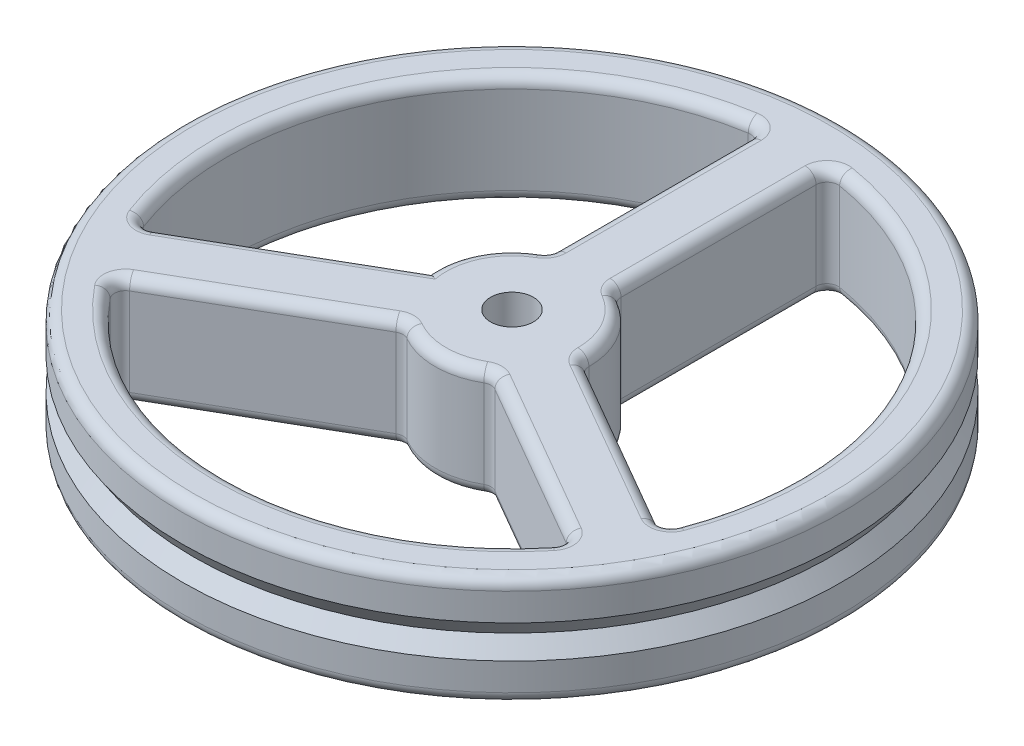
ISO-10303-21;
HEADER;
FILE_DESCRIPTION(('STEP AP214'),'2;1');
FILE_NAME('part.step','',(''),(''),'','','');
FILE_SCHEMA(('AUTOMOTIVE_DESIGN { 1 0 10303 214 1 1 1 1 }'));
ENDSEC;
DATA;
#1=APPLICATION_CONTEXT('core data for automotive mechanical design processes');
#2=APPLICATION_PROTOCOL_DEFINITION('international standard','automotive_design',2000,#1);
#3=PRODUCT_CONTEXT('',#1,'mechanical');
#4=PRODUCT('Part','Part','',(#3));
#5=PRODUCT_RELATED_PRODUCT_CATEGORY('part','',(#4));
#6=PRODUCT_DEFINITION_FORMATION('','',#4);
#7=PRODUCT_DEFINITION_CONTEXT('part definition',#1,'design');
#8=PRODUCT_DEFINITION('design','',#6,#7);
#9=PRODUCT_DEFINITION_SHAPE('','',#8);
#10=(LENGTH_UNIT() NAMED_UNIT(*) SI_UNIT(.MILLI.,.METRE.));
#11=(NAMED_UNIT(*) PLANE_ANGLE_UNIT() SI_UNIT($,.RADIAN.));
#12=(NAMED_UNIT(*) SI_UNIT($,.STERADIAN.) SOLID_ANGLE_UNIT());
#13=UNCERTAINTY_MEASURE_WITH_UNIT(LENGTH_MEASURE(1.E-05),#10,'distance_accuracy_value','');
#14=(GEOMETRIC_REPRESENTATION_CONTEXT(3) GLOBAL_UNCERTAINTY_ASSIGNED_CONTEXT((#13)) GLOBAL_UNIT_ASSIGNED_CONTEXT((#10,
#11,#12)) REPRESENTATION_CONTEXT('',''));
#15=CARTESIAN_POINT('',(0.,0.,0.));
#16=DIRECTION('',(0.,0.,1.));
#17=DIRECTION('',(1.,0.,0.));
#18=AXIS2_PLACEMENT_3D('',#15,#16,#17);
#19=CARTESIAN_POINT('',(0.,10.,0.));
#20=DIRECTION('',(0.,-1.,0.));
#21=DIRECTION('',(0.,0.,-1.));
#22=AXIS2_PLACEMENT_3D('',#19,#20,#21);
#23=CYLINDRICAL_SURFACE('',#22,30.);
#24=CARTESIAN_POINT('',(0.,6.5,0.));
#25=DIRECTION('',(0.,1.,0.));
#26=DIRECTION('',(0.,0.,1.));
#27=AXIS2_PLACEMENT_3D('',#24,#25,#26);
#28=CIRCLE('',#27,30.);
#29=CARTESIAN_POINT('',(0.,6.5,30.));
#30=VERTEX_POINT('',#29);
#31=EDGE_CURVE('E1644',#30,#30,#28,.T.);
#32=ORIENTED_EDGE('',*,*,#31,.T.);
#33=EDGE_LOOP('',(#32));
#34=FACE_BOUND('',#33,.T.);
#35=CARTESIAN_POINT('',(0.,9.,0.));
#36=DIRECTION('',(0.,1.,0.));
#37=DIRECTION('',(0.,0.,1.));
#38=AXIS2_PLACEMENT_3D('',#35,#36,#37);
#39=CIRCLE('',#38,30.);
#40=CARTESIAN_POINT('',(0.,9.,30.));
#41=VERTEX_POINT('',#40);
#42=EDGE_CURVE('E55',#41,#41,#39,.F.);
#43=ORIENTED_EDGE('',*,*,#42,.T.);
#44=EDGE_LOOP('',(#43));
#45=FACE_BOUND('',#44,.T.);
#46=ADVANCED_FACE('F45',(#34,#45),#23,.T.);
#47=CARTESIAN_POINT('',(0.,0.,0.));
#48=DIRECTION('',(0.,1.,0.));
#49=DIRECTION('',(0.,0.,1.));
#50=AXIS2_PLACEMENT_3D('',#47,#48,#49);
#51=PLANE('',#50);
#52=CARTESIAN_POINT('',(0.,0.,0.));
#53=DIRECTION('',(0.,-1.,0.));
#54=DIRECTION('',(0.,0.,-1.));
#55=AXIS2_PLACEMENT_3D('',#52,#53,#54);
#56=CIRCLE('',#55,1.95);
#57=CARTESIAN_POINT('',(0.,0.,-1.95));
#58=VERTEX_POINT('',#57);
#59=EDGE_CURVE('E1634',#58,#58,#56,.T.);
#60=ORIENTED_EDGE('',*,*,#59,.F.);
#61=EDGE_LOOP('',(#60));
#62=FACE_BOUND('',#61,.T.);
#63=DIRECTION('',(0.866025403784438,0.,-0.5));
#64=VECTOR('',#63,1.);
#65=CARTESIAN_POINT('',(-6.47722557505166,0.,1.43022685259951));
#66=LINE('',#65,#64);
#67=CARTESIAN_POINT('',(-22.3717102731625,0.,10.6069118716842));
#68=VERTEX_POINT('',#67);
#69=CARTESIAN_POINT('',(-5.89897948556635,0.,1.09637631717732));
#70=VERTEX_POINT('',#69);
#71=EDGE_CURVE('E546',#68,#70,#66,.T.);
#72=ORIENTED_EDGE('',*,*,#71,.T.);
#73=CARTESIAN_POINT('',(0.,0.,0.));
#74=DIRECTION('',(0.,1.,0.));
#75=DIRECTION('',(0.,0.,1.));
#76=AXIS2_PLACEMENT_3D('',#73,#74,#75);
#77=CIRCLE('',#76,6.);
#78=CARTESIAN_POINT('',(-3.,0.,-5.19615242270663));
#79=VERTEX_POINT('',#78);
#80=EDGE_CURVE('E552',#70,#79,#77,.F.);
#81=ORIENTED_EDGE('',*,*,#80,.T.);
#82=CARTESIAN_POINT('',(-4.,0.,-6.92820323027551));
#83=DIRECTION('',(0.,1.,0.));
#84=DIRECTION('',(0.,0.,1.));
#85=AXIS2_PLACEMENT_3D('',#82,#83,#84);
#86=CIRCLE('',#85,2.);
#87=CARTESIAN_POINT('',(-2.,0.,-6.92820323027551));
#88=VERTEX_POINT('',#87);
#89=EDGE_CURVE('E549',#88,#79,#86,.F.);
#90=ORIENTED_EDGE('',*,*,#89,.F.);
#91=DIRECTION('',(0.,0.,-1.));
#92=VECTOR('',#91,1.);
#93=CARTESIAN_POINT('',(-2.,0.,-25.8263431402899));
#94=LINE('',#93,#92);
#95=CARTESIAN_POINT('',(-2.,0.,-24.6779253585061));
#96=VERTEX_POINT('',#95);
#97=EDGE_CURVE('E543',#88,#96,#94,.T.);
#98=ORIENTED_EDGE('',*,*,#97,.T.);
#99=CARTESIAN_POINT('',(-4.,0.,-24.6779253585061));
#100=DIRECTION('',(0.,1.,0.));
#101=DIRECTION('',(0.,0.,1.));
#102=AXIS2_PLACEMENT_3D('',#99,#100,#101);
#103=CIRCLE('',#102,2.);
#104=CARTESIAN_POINT('',(-4.32,0.,-26.6521593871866));
#105=VERTEX_POINT('',#104);
#106=EDGE_CURVE('E539',#105,#96,#103,.F.);
#107=ORIENTED_EDGE('',*,*,#106,.F.);
#108=CARTESIAN_POINT('',(0.,0.,0.));
#109=DIRECTION('',(0.,1.,0.));
#110=DIRECTION('',(0.,0.,1.));
#111=AXIS2_PLACEMENT_3D('',#108,#109,#110);
#112=CIRCLE('',#111,27.);
#113=CARTESIAN_POINT('',(-25.2414470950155,0.,9.58484994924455));
#114=VERTEX_POINT('',#113);
#115=EDGE_CURVE('E536',#105,#114,#112,.T.);
#116=ORIENTED_EDGE('',*,*,#115,.T.);
#117=CARTESIAN_POINT('',(-23.3717102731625,0.,8.87486106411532));
#118=DIRECTION('',(0.,1.,0.));
#119=DIRECTION('',(0.,0.,1.));
#120=AXIS2_PLACEMENT_3D('',#117,#118,#119);
#121=CIRCLE('',#120,2.);
#122=EDGE_CURVE('E532',#68,#114,#121,.F.);
#123=ORIENTED_EDGE('',*,*,#122,.F.);
#124=EDGE_LOOP('',(#72,#81,#90,#98,#107,#116,#123));
#125=FACE_BOUND('',#124,.T.);
#126=CARTESIAN_POINT('',(19.3717102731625,0.,15.8030642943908));
#127=DIRECTION('',(0.,1.,0.));
#128=DIRECTION('',(0.,0.,1.));
#129=AXIS2_PLACEMENT_3D('',#126,#127,#128);
#130=CIRCLE('',#129,2.);
#131=CARTESIAN_POINT('',(20.3717102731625,0.,14.0710134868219));
#132=VERTEX_POINT('',#131);
#133=CARTESIAN_POINT('',(20.9214470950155,0.,17.0673094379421));
#134=VERTEX_POINT('',#133);
#135=EDGE_CURVE('E501',#132,#134,#130,.F.);
#136=ORIENTED_EDGE('',*,*,#135,.F.);
#137=DIRECTION('',(-0.866025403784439,0.,-0.5));
#138=VECTOR('',#137,1.);
#139=CARTESIAN_POINT('',(4.47722557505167,0.,4.89432846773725));
#140=LINE('',#139,#138);
#141=CARTESIAN_POINT('',(5.,0.,5.19615242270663));
#142=VERTEX_POINT('',#141);
#143=EDGE_CURVE('E498',#132,#142,#140,.T.);
#144=ORIENTED_EDGE('',*,*,#143,.T.);
#145=CARTESIAN_POINT('',(4.,0.,6.92820323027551));
#146=DIRECTION('',(0.,1.,0.));
#147=DIRECTION('',(0.,0.,1.));
#148=AXIS2_PLACEMENT_3D('',#145,#146,#147);
#149=CIRCLE('',#148,2.);
#150=CARTESIAN_POINT('',(3.,0.,5.19615242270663));
#151=VERTEX_POINT('',#150);
#152=EDGE_CURVE('E494',#151,#142,#149,.F.);
#153=ORIENTED_EDGE('',*,*,#152,.F.);
#154=CARTESIAN_POINT('',(0.,0.,0.));
#155=DIRECTION('',(0.,1.,0.));
#156=DIRECTION('',(0.,0.,1.));
#157=AXIS2_PLACEMENT_3D('',#154,#155,#156);
#158=CIRCLE('',#157,6.);
#159=CARTESIAN_POINT('',(-3.,0.,5.19615242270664));
#160=VERTEX_POINT('',#159);
#161=EDGE_CURVE('E487',#151,#160,#158,.F.);
#162=ORIENTED_EDGE('',*,*,#161,.T.);
#163=CARTESIAN_POINT('',(-3.99999999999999,0.,6.92820323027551));
#164=DIRECTION('',(0.,1.,0.));
#165=DIRECTION('',(0.,0.,1.));
#166=AXIS2_PLACEMENT_3D('',#163,#164,#165);
#167=CIRCLE('',#166,2.);
#168=CARTESIAN_POINT('',(-5.,0.,5.19615242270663));
#169=VERTEX_POINT('',#168);
#170=EDGE_CURVE('E483',#169,#160,#167,.F.);
#171=ORIENTED_EDGE('',*,*,#170,.F.);
#172=DIRECTION('',(-0.866025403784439,0.,0.5));
#173=VECTOR('',#172,1.);
#174=CARTESIAN_POINT('',(-21.3662692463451,0.,14.6452223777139));
#175=LINE('',#174,#173);
#176=CARTESIAN_POINT('',(-20.3717102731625,0.,14.071013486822));
#177=VERTEX_POINT('',#176);
#178=EDGE_CURVE('E480',#169,#177,#175,.T.);
#179=ORIENTED_EDGE('',*,*,#178,.T.);
#180=CARTESIAN_POINT('',(-19.3717102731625,0.,15.8030642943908));
#181=DIRECTION('',(0.,1.,0.));
#182=DIRECTION('',(0.,0.,1.));
#183=AXIS2_PLACEMENT_3D('',#180,#181,#182);
#184=CIRCLE('',#183,2.);
#185=CARTESIAN_POINT('',(-20.9214470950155,0.,17.0673094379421));
#186=VERTEX_POINT('',#185);
#187=EDGE_CURVE('E476',#186,#177,#184,.F.);
#188=ORIENTED_EDGE('',*,*,#187,.F.);
#189=CARTESIAN_POINT('',(0.,0.,0.));
#190=DIRECTION('',(0.,1.,0.));
#191=DIRECTION('',(0.,0.,1.));
#192=AXIS2_PLACEMENT_3D('',#189,#190,#191);
#193=CIRCLE('',#192,27.);
#194=EDGE_CURVE('E490',#186,#134,#193,.T.);
#195=ORIENTED_EDGE('',*,*,#194,.T.);
#196=EDGE_LOOP('',(#136,#144,#153,#162,#171,#179,#188,#195));
#197=FACE_BOUND('',#196,.T.);
#198=CARTESIAN_POINT('',(0.,0.,0.));
#199=DIRECTION('',(0.,1.,0.));
#200=DIRECTION('',(0.,0.,1.));
#201=AXIS2_PLACEMENT_3D('',#198,#199,#200);
#202=CIRCLE('',#201,29.);
#203=CARTESIAN_POINT('',(0.,0.,29.));
#204=VERTEX_POINT('',#203);
#205=EDGE_CURVE('E472',#204,#204,#202,.F.);
#206=ORIENTED_EDGE('',*,*,#205,.T.);
#207=EDGE_LOOP('',(#206));
#208=FACE_BOUND('',#207,.T.);
#209=CARTESIAN_POINT('',(8.,0.,0.));
#210=DIRECTION('',(0.,1.,0.));
#211=DIRECTION('',(0.,0.,1.));
#212=AXIS2_PLACEMENT_3D('',#209,#210,#211);
#213=CIRCLE('',#212,2.);
#214=CARTESIAN_POINT('',(7.,0.,1.73205080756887));
#215=VERTEX_POINT('',#214);
#216=CARTESIAN_POINT('',(6.,0.,0.));
#217=VERTEX_POINT('',#216);
#218=EDGE_CURVE('E529',#215,#217,#213,.F.);
#219=ORIENTED_EDGE('',*,*,#218,.F.);
#220=DIRECTION('',(0.866025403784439,0.,0.5));
#221=VECTOR('',#220,1.);
#222=CARTESIAN_POINT('',(23.3662692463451,0.,11.1811207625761));
#223=LINE('',#222,#221);
#224=CARTESIAN_POINT('',(22.3717102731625,0.,10.6069118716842));
#225=VERTEX_POINT('',#224);
#226=EDGE_CURVE('E526',#215,#225,#223,.T.);
#227=ORIENTED_EDGE('',*,*,#226,.T.);
#228=CARTESIAN_POINT('',(23.3717102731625,0.,8.87486106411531));
#229=DIRECTION('',(0.,1.,0.));
#230=DIRECTION('',(0.,0.,1.));
#231=AXIS2_PLACEMENT_3D('',#228,#229,#230);
#232=CIRCLE('',#231,2.);
#233=CARTESIAN_POINT('',(25.2414470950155,0.,9.58484994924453));
#234=VERTEX_POINT('',#233);
#235=EDGE_CURVE('E522',#234,#225,#232,.F.);
#236=ORIENTED_EDGE('',*,*,#235,.F.);
#237=CARTESIAN_POINT('',(0.,0.,0.));
#238=DIRECTION('',(0.,1.,0.));
#239=DIRECTION('',(0.,0.,1.));
#240=AXIS2_PLACEMENT_3D('',#237,#238,#239);
#241=CIRCLE('',#240,27.);
#242=CARTESIAN_POINT('',(4.32,0.,-26.6521593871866));
#243=VERTEX_POINT('',#242);
#244=EDGE_CURVE('E515',#234,#243,#241,.T.);
#245=ORIENTED_EDGE('',*,*,#244,.T.);
#246=CARTESIAN_POINT('',(4.,0.,-24.6779253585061));
#247=DIRECTION('',(0.,1.,0.));
#248=DIRECTION('',(0.,0.,1.));
#249=AXIS2_PLACEMENT_3D('',#246,#247,#248);
#250=CIRCLE('',#249,2.);
#251=CARTESIAN_POINT('',(2.,0.,-24.6779253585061));
#252=VERTEX_POINT('',#251);
#253=EDGE_CURVE('E511',#252,#243,#250,.F.);
#254=ORIENTED_EDGE('',*,*,#253,.F.);
#255=DIRECTION('',(0.,0.,1.));
#256=VECTOR('',#255,1.);
#257=CARTESIAN_POINT('',(2.,0.,-6.32455532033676));
#258=LINE('',#257,#256);
#259=CARTESIAN_POINT('',(2.,0.,-6.92820323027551));
#260=VERTEX_POINT('',#259);
#261=EDGE_CURVE('E508',#252,#260,#258,.T.);
#262=ORIENTED_EDGE('',*,*,#261,.T.);
#263=CARTESIAN_POINT('',(4.,0.,-6.92820323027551));
#264=DIRECTION('',(0.,1.,0.));
#265=DIRECTION('',(0.,0.,1.));
#266=AXIS2_PLACEMENT_3D('',#263,#264,#265);
#267=CIRCLE('',#266,2.);
#268=CARTESIAN_POINT('',(3.,0.,-5.19615242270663));
#269=VERTEX_POINT('',#268);
#270=EDGE_CURVE('E504',#269,#260,#267,.F.);
#271=ORIENTED_EDGE('',*,*,#270,.F.);
#272=CARTESIAN_POINT('',(0.,0.,0.));
#273=DIRECTION('',(0.,1.,0.));
#274=DIRECTION('',(0.,0.,1.));
#275=AXIS2_PLACEMENT_3D('',#272,#273,#274);
#276=CIRCLE('',#275,6.);
#277=EDGE_CURVE('E518',#269,#217,#276,.F.);
#278=ORIENTED_EDGE('',*,*,#277,.T.);
#279=EDGE_LOOP('',(#219,#227,#236,#245,#254,#262,#271,#278));
#280=FACE_BOUND('',#279,.T.);
#281=ADVANCED_FACE('F993',(#62,#125,#197,#208,#280),#51,.F.);
#282=CARTESIAN_POINT('',(0.,10.,0.));
#283=DIRECTION('',(0.,1.,0.));
#284=DIRECTION('',(0.,0.,1.));
#285=AXIS2_PLACEMENT_3D('',#282,#283,#284);
#286=PLANE('',#285);
#287=CARTESIAN_POINT('',(0.,10.,0.));
#288=DIRECTION('',(0.,1.,0.));
#289=DIRECTION('',(0.,0.,1.));
#290=AXIS2_PLACEMENT_3D('',#287,#288,#289);
#291=CIRCLE('',#290,1.95);
#292=CARTESIAN_POINT('',(0.,10.,1.95));
#293=VERTEX_POINT('',#292);
#294=EDGE_CURVE('E49',#293,#293,#291,.T.);
#295=ORIENTED_EDGE('',*,*,#294,.F.);
#296=EDGE_LOOP('',(#295));
#297=FACE_BOUND('',#296,.T.);
#298=CARTESIAN_POINT('',(23.3717102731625,10.,8.87486106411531));
#299=DIRECTION('',(0.,1.,0.));
#300=DIRECTION('',(0.,0.,1.));
#301=AXIS2_PLACEMENT_3D('',#298,#299,#300);
#302=CIRCLE('',#301,2.);
#303=CARTESIAN_POINT('',(22.3717102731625,10.,10.6069118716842));
#304=VERTEX_POINT('',#303);
#305=CARTESIAN_POINT('',(25.2414470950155,10.,9.58484994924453));
#306=VERTEX_POINT('',#305);
#307=EDGE_CURVE('E445',#304,#306,#302,.T.);
#308=ORIENTED_EDGE('',*,*,#307,.F.);
#309=DIRECTION('',(0.866025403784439,0.,0.5));
#310=VECTOR('',#309,1.);
#311=CARTESIAN_POINT('',(1.,10.,-1.73205080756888));
#312=LINE('',#311,#310);
#313=CARTESIAN_POINT('',(7.,10.,1.73205080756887));
#314=VERTEX_POINT('',#313);
#315=EDGE_CURVE('E442',#304,#314,#312,.F.);
#316=ORIENTED_EDGE('',*,*,#315,.T.);
#317=CARTESIAN_POINT('',(8.,10.,0.));
#318=DIRECTION('',(0.,1.,0.));
#319=DIRECTION('',(0.,0.,1.));
#320=AXIS2_PLACEMENT_3D('',#317,#318,#319);
#321=CIRCLE('',#320,2.);
#322=CARTESIAN_POINT('',(6.,10.,0.));
#323=VERTEX_POINT('',#322);
#324=EDGE_CURVE('E438',#323,#314,#321,.T.);
#325=ORIENTED_EDGE('',*,*,#324,.F.);
#326=CARTESIAN_POINT('',(0.,10.,0.));
#327=DIRECTION('',(0.,1.,0.));
#328=DIRECTION('',(0.,0.,1.));
#329=AXIS2_PLACEMENT_3D('',#326,#327,#328);
#330=CIRCLE('',#329,6.);
#331=CARTESIAN_POINT('',(3.,10.,-5.19615242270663));
#332=VERTEX_POINT('',#331);
#333=EDGE_CURVE('E434',#323,#332,#330,.T.);
#334=ORIENTED_EDGE('',*,*,#333,.T.);
#335=CARTESIAN_POINT('',(4.,10.,-6.92820323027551));
#336=DIRECTION('',(0.,1.,0.));
#337=DIRECTION('',(0.,0.,1.));
#338=AXIS2_PLACEMENT_3D('',#335,#336,#337);
#339=CIRCLE('',#338,2.);
#340=CARTESIAN_POINT('',(2.,10.,-6.92820323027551));
#341=VERTEX_POINT('',#340);
#342=EDGE_CURVE('E430',#341,#332,#339,.T.);
#343=ORIENTED_EDGE('',*,*,#342,.F.);
#344=DIRECTION('',(0.,0.,1.));
#345=VECTOR('',#344,1.);
#346=CARTESIAN_POINT('',(2.,10.,0.));
#347=LINE('',#346,#345);
#348=CARTESIAN_POINT('',(2.,10.,-24.6779253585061));
#349=VERTEX_POINT('',#348);
#350=EDGE_CURVE('E424',#341,#349,#347,.F.);
#351=ORIENTED_EDGE('',*,*,#350,.T.);
#352=CARTESIAN_POINT('',(4.,10.,-24.6779253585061));
#353=DIRECTION('',(0.,1.,0.));
#354=DIRECTION('',(0.,0.,1.));
#355=AXIS2_PLACEMENT_3D('',#352,#353,#354);
#356=CIRCLE('',#355,2.);
#357=CARTESIAN_POINT('',(4.32,10.,-26.6521593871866));
#358=VERTEX_POINT('',#357);
#359=EDGE_CURVE('E420',#358,#349,#356,.T.);
#360=ORIENTED_EDGE('',*,*,#359,.F.);
#361=CARTESIAN_POINT('',(0.,10.,0.));
#362=DIRECTION('',(0.,1.,0.));
#363=DIRECTION('',(0.,0.,1.));
#364=AXIS2_PLACEMENT_3D('',#361,#362,#363);
#365=CIRCLE('',#364,27.);
#366=EDGE_CURVE('E427',#358,#306,#365,.F.);
#367=ORIENTED_EDGE('',*,*,#366,.T.);
#368=EDGE_LOOP('',(#308,#316,#325,#334,#343,#351,#360,#367));
#369=FACE_BOUND('',#368,.T.);
#370=CARTESIAN_POINT('',(0.,10.,0.));
#371=DIRECTION('',(0.,1.,0.));
#372=DIRECTION('',(0.,0.,1.));
#373=AXIS2_PLACEMENT_3D('',#370,#371,#372);
#374=CIRCLE('',#373,29.);
#375=CARTESIAN_POINT('',(0.,10.,29.));
#376=VERTEX_POINT('',#375);
#377=EDGE_CURVE('E382',#376,#376,#374,.T.);
#378=ORIENTED_EDGE('',*,*,#377,.T.);
#379=EDGE_LOOP('',(#378));
#380=FACE_BOUND('',#379,.T.);
#381=CARTESIAN_POINT('',(4.,10.,6.92820323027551));
#382=DIRECTION('',(0.,1.,0.));
#383=DIRECTION('',(0.,0.,1.));
#384=AXIS2_PLACEMENT_3D('',#381,#382,#383);
#385=CIRCLE('',#384,2.);
#386=CARTESIAN_POINT('',(5.,10.,5.19615242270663));
#387=VERTEX_POINT('',#386);
#388=CARTESIAN_POINT('',(3.,10.,5.19615242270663));
#389=VERTEX_POINT('',#388);
#390=EDGE_CURVE('E416',#387,#389,#385,.T.);
#391=ORIENTED_EDGE('',*,*,#390,.F.);
#392=DIRECTION('',(-0.866025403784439,0.,-0.5));
#393=VECTOR('',#392,1.);
#394=CARTESIAN_POINT('',(-0.999999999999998,10.,1.73205080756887));
#395=LINE('',#394,#393);
#396=CARTESIAN_POINT('',(20.3717102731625,10.,14.0710134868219));
#397=VERTEX_POINT('',#396);
#398=EDGE_CURVE('E413',#387,#397,#395,.F.);
#399=ORIENTED_EDGE('',*,*,#398,.T.);
#400=CARTESIAN_POINT('',(19.3717102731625,10.,15.8030642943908));
#401=DIRECTION('',(0.,1.,0.));
#402=DIRECTION('',(0.,0.,1.));
#403=AXIS2_PLACEMENT_3D('',#400,#401,#402);
#404=CIRCLE('',#403,2.);
#405=CARTESIAN_POINT('',(20.9214470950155,10.,17.0673094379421));
#406=VERTEX_POINT('',#405);
#407=EDGE_CURVE('E409',#406,#397,#404,.T.);
#408=ORIENTED_EDGE('',*,*,#407,.F.);
#409=CARTESIAN_POINT('',(0.,10.,0.));
#410=DIRECTION('',(0.,1.,0.));
#411=DIRECTION('',(0.,0.,1.));
#412=AXIS2_PLACEMENT_3D('',#409,#410,#411);
#413=CIRCLE('',#412,27.);
#414=CARTESIAN_POINT('',(-20.9214470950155,10.,17.0673094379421));
#415=VERTEX_POINT('',#414);
#416=EDGE_CURVE('E405',#406,#415,#413,.F.);
#417=ORIENTED_EDGE('',*,*,#416,.T.);
#418=CARTESIAN_POINT('',(-19.3717102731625,10.,15.8030642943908));
#419=DIRECTION('',(0.,1.,0.));
#420=DIRECTION('',(0.,0.,1.));
#421=AXIS2_PLACEMENT_3D('',#418,#419,#420);
#422=CIRCLE('',#421,2.);
#423=CARTESIAN_POINT('',(-20.3717102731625,10.,14.071013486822));
#424=VERTEX_POINT('',#423);
#425=EDGE_CURVE('E401',#424,#415,#422,.T.);
#426=ORIENTED_EDGE('',*,*,#425,.F.);
#427=DIRECTION('',(-0.866025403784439,0.,0.5));
#428=VECTOR('',#427,1.);
#429=CARTESIAN_POINT('',(1.,10.,1.73205080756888));
#430=LINE('',#429,#428);
#431=CARTESIAN_POINT('',(-5.,10.,5.19615242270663));
#432=VERTEX_POINT('',#431);
#433=EDGE_CURVE('E395',#424,#432,#430,.F.);
#434=ORIENTED_EDGE('',*,*,#433,.T.);
#435=CARTESIAN_POINT('',(-3.99999999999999,10.,6.92820323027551));
#436=DIRECTION('',(0.,1.,0.));
#437=DIRECTION('',(0.,0.,1.));
#438=AXIS2_PLACEMENT_3D('',#435,#436,#437);
#439=CIRCLE('',#438,2.);
#440=CARTESIAN_POINT('',(-3.,10.,5.19615242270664));
#441=VERTEX_POINT('',#440);
#442=EDGE_CURVE('E387',#441,#432,#439,.T.);
#443=ORIENTED_EDGE('',*,*,#442,.F.);
#444=CARTESIAN_POINT('',(0.,10.,0.));
#445=DIRECTION('',(0.,1.,0.));
#446=DIRECTION('',(0.,0.,1.));
#447=AXIS2_PLACEMENT_3D('',#444,#445,#446);
#448=CIRCLE('',#447,6.);
#449=EDGE_CURVE('E398',#441,#389,#448,.T.);
#450=ORIENTED_EDGE('',*,*,#449,.T.);
#451=EDGE_LOOP('',(#391,#399,#408,#417,#426,#434,#443,#450));
#452=FACE_BOUND('',#451,.T.);
#453=CARTESIAN_POINT('',(-4.,10.,-6.92820323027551));
#454=DIRECTION('',(0.,1.,0.));
#455=DIRECTION('',(0.,0.,1.));
#456=AXIS2_PLACEMENT_3D('',#453,#454,#455);
#457=CIRCLE('',#456,2.);
#458=CARTESIAN_POINT('',(-3.,10.,-5.19615242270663));
#459=VERTEX_POINT('',#458);
#460=CARTESIAN_POINT('',(-2.,10.,-6.92820323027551));
#461=VERTEX_POINT('',#460);
#462=EDGE_CURVE('E468',#459,#461,#457,.T.);
#463=ORIENTED_EDGE('',*,*,#462,.F.);
#464=CARTESIAN_POINT('',(0.,10.,0.));
#465=DIRECTION('',(0.,1.,0.));
#466=DIRECTION('',(0.,0.,1.));
#467=AXIS2_PLACEMENT_3D('',#464,#465,#466);
#468=CIRCLE('',#467,6.);
#469=CARTESIAN_POINT('',(-5.89897948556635,10.,1.09637631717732));
#470=VERTEX_POINT('',#469);
#471=EDGE_CURVE('E465',#459,#470,#468,.T.);
#472=ORIENTED_EDGE('',*,*,#471,.T.);
#473=DIRECTION('',(0.866025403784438,0.,-0.5));
#474=VECTOR('',#473,1.);
#475=CARTESIAN_POINT('',(-0.999999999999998,10.,-1.73205080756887));
#476=LINE('',#475,#474);
#477=CARTESIAN_POINT('',(-22.3717102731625,10.,10.6069118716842));
#478=VERTEX_POINT('',#477);
#479=EDGE_CURVE('E370',#470,#478,#476,.F.);
#480=ORIENTED_EDGE('',*,*,#479,.T.);
#481=CARTESIAN_POINT('',(-23.3717102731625,10.,8.87486106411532));
#482=DIRECTION('',(0.,1.,0.));
#483=DIRECTION('',(0.,0.,1.));
#484=AXIS2_PLACEMENT_3D('',#481,#482,#483);
#485=CIRCLE('',#484,2.);
#486=CARTESIAN_POINT('',(-25.2414470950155,10.,9.58484994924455));
#487=VERTEX_POINT('',#486);
#488=EDGE_CURVE('E459',#487,#478,#485,.T.);
#489=ORIENTED_EDGE('',*,*,#488,.F.);
#490=CARTESIAN_POINT('',(0.,10.,0.));
#491=DIRECTION('',(0.,1.,0.));
#492=DIRECTION('',(0.,0.,1.));
#493=AXIS2_PLACEMENT_3D('',#490,#491,#492);
#494=CIRCLE('',#493,27.);
#495=CARTESIAN_POINT('',(-4.32,10.,-26.6521593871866));
#496=VERTEX_POINT('',#495);
#497=EDGE_CURVE('E453',#487,#496,#494,.F.);
#498=ORIENTED_EDGE('',*,*,#497,.T.);
#499=CARTESIAN_POINT('',(-4.,10.,-24.6779253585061));
#500=DIRECTION('',(0.,1.,0.));
#501=DIRECTION('',(0.,0.,1.));
#502=AXIS2_PLACEMENT_3D('',#499,#500,#501);
#503=CIRCLE('',#502,2.);
#504=CARTESIAN_POINT('',(-2.,10.,-24.6779253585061));
#505=VERTEX_POINT('',#504);
#506=EDGE_CURVE('E449',#505,#496,#503,.T.);
#507=ORIENTED_EDGE('',*,*,#506,.F.);
#508=DIRECTION('',(0.,0.,-1.));
#509=VECTOR('',#508,1.);
#510=CARTESIAN_POINT('',(-2.,10.,0.));
#511=LINE('',#510,#509);
#512=EDGE_CURVE('E456',#505,#461,#511,.F.);
#513=ORIENTED_EDGE('',*,*,#512,.T.);
#514=EDGE_LOOP('',(#463,#472,#480,#489,#498,#507,#513));
#515=FACE_BOUND('',#514,.T.);
#516=ADVANCED_FACE('F1015',(#297,#369,#380,#452,#515),#286,.T.);
#517=CARTESIAN_POINT('',(0.,3.5,0.));
#518=DIRECTION('',(0.,1.,0.));
#519=DIRECTION('',(0.,0.,1.));
#520=AXIS2_PLACEMENT_3D('',#517,#518,#519);
#521=CIRCLE('',#520,30.);
#522=CARTESIAN_POINT('',(0.,3.5,30.));
#523=VERTEX_POINT('',#522);
#524=EDGE_CURVE('E1078',#523,#523,#521,.T.);
#525=ORIENTED_EDGE('',*,*,#524,.F.);
#526=EDGE_LOOP('',(#525));
#527=FACE_BOUND('',#526,.T.);
#528=CARTESIAN_POINT('',(0.,0.999999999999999,0.));
#529=DIRECTION('',(0.,1.,0.));
#530=DIRECTION('',(0.,0.,1.));
#531=AXIS2_PLACEMENT_3D('',#528,#529,#530);
#532=CIRCLE('',#531,30.);
#533=CARTESIAN_POINT('',(0.,0.999999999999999,30.));
#534=VERTEX_POINT('',#533);
#535=EDGE_CURVE('E11',#534,#534,#532,.T.);
#536=ORIENTED_EDGE('',*,*,#535,.T.);
#537=EDGE_LOOP('',(#536));
#538=FACE_BOUND('',#537,.T.);
#539=ADVANCED_FACE('F1053',(#527,#538),#23,.T.);
#540=CARTESIAN_POINT('',(0.,10.,0.));
#541=DIRECTION('',(0.,-1.,0.));
#542=DIRECTION('',(0.,0.,-1.));
#543=AXIS2_PLACEMENT_3D('',#540,#541,#542);
#544=CYLINDRICAL_SURFACE('',#543,26.);
#545=CARTESIAN_POINT('',(0.,0.999999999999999,0.));
#546=DIRECTION('',(0.,1.,0.));
#547=DIRECTION('',(0.,0.,1.));
#548=AXIS2_PLACEMENT_3D('',#545,#546,#547);
#549=CIRCLE('',#548,26.);
#550=CARTESIAN_POINT('',(4.16,0.999999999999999,-25.6650423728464));
#551=VERTEX_POINT('',#550);
#552=CARTESIAN_POINT('',(24.306578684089,0.999999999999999,9.22985550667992));
#553=VERTEX_POINT('',#552);
#554=EDGE_CURVE('E575',#551,#553,#549,.F.);
#555=ORIENTED_EDGE('',*,*,#554,.T.);
#556=DIRECTION('',(0.,-1.,0.));
#557=VECTOR('',#556,1.);
#558=CARTESIAN_POINT('',(24.306578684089,10.,9.22985550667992));
#559=LINE('',#558,#557);
#560=CARTESIAN_POINT('',(24.306578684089,9.,9.22985550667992));
#561=VERTEX_POINT('',#560);
#562=EDGE_CURVE('E582',#553,#561,#559,.F.);
#563=ORIENTED_EDGE('',*,*,#562,.T.);
#564=CARTESIAN_POINT('',(0.,9.,0.));
#565=DIRECTION('',(0.,1.,0.));
#566=DIRECTION('',(0.,0.,1.));
#567=AXIS2_PLACEMENT_3D('',#564,#565,#566);
#568=CIRCLE('',#567,26.);
#569=CARTESIAN_POINT('',(4.16,9.,-25.6650423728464));
#570=VERTEX_POINT('',#569);
#571=EDGE_CURVE('E578',#561,#570,#568,.T.);
#572=ORIENTED_EDGE('',*,*,#571,.T.);
#573=DIRECTION('',(0.,-1.,0.));
#574=VECTOR('',#573,1.);
#575=CARTESIAN_POINT('',(4.16,10.,-25.6650423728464));
#576=LINE('',#575,#574);
#577=EDGE_CURVE('E572',#570,#551,#576,.T.);
#578=ORIENTED_EDGE('',*,*,#577,.T.);
#579=EDGE_LOOP('',(#555,#563,#572,#578));
#580=FACE_BOUND('',#579,.T.);
#581=ADVANCED_FACE('F1063',(#580),#544,.F.);
#582=CARTESIAN_POINT('',(3.,10.,-25.8263431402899));
#583=DIRECTION('',(1.,0.,0.));
#584=DIRECTION('',(0.,0.,-1.));
#585=AXIS2_PLACEMENT_3D('',#582,#583,#584);
#586=PLANE('',#585);
#587=DIRECTION('',(0.,0.,1.));
#588=VECTOR('',#587,1.);
#589=CARTESIAN_POINT('',(3.,9.,-25.8263431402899));
#590=LINE('',#589,#588);
#591=CARTESIAN_POINT('',(3.,9.,-24.6779253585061));
#592=VERTEX_POINT('',#591);
#593=CARTESIAN_POINT('',(3.,9.,-6.92820323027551));
#594=VERTEX_POINT('',#593);
#595=EDGE_CURVE('E669',#592,#594,#590,.T.);
#596=ORIENTED_EDGE('',*,*,#595,.T.);
#597=DIRECTION('',(0.,1.,0.));
#598=VECTOR('',#597,1.);
#599=CARTESIAN_POINT('',(3.,0.,-6.92820323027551));
#600=LINE('',#599,#598);
#601=CARTESIAN_POINT('',(3.,1.,-6.92820323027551));
#602=VERTEX_POINT('',#601);
#603=EDGE_CURVE('E672',#594,#602,#600,.F.);
#604=ORIENTED_EDGE('',*,*,#603,.T.);
#605=DIRECTION('',(0.,0.,1.));
#606=VECTOR('',#605,1.);
#607=CARTESIAN_POINT('',(3.,1.,-25.8263431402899));
#608=LINE('',#607,#606);
#609=CARTESIAN_POINT('',(3.,1.,-24.6779253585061));
#610=VERTEX_POINT('',#609);
#611=EDGE_CURVE('E663',#602,#610,#608,.F.);
#612=ORIENTED_EDGE('',*,*,#611,.T.);
#613=DIRECTION('',(0.,1.,0.));
#614=VECTOR('',#613,1.);
#615=CARTESIAN_POINT('',(3.,10.,-24.6779253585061));
#616=LINE('',#615,#614);
#617=EDGE_CURVE('E666',#610,#592,#616,.T.);
#618=ORIENTED_EDGE('',*,*,#617,.T.);
#619=EDGE_LOOP('',(#596,#604,#612,#618));
#620=FACE_BOUND('',#619,.T.);
#621=ADVANCED_FACE('F1069',(#620),#586,.T.);
#622=CARTESIAN_POINT('',(0.,10.,0.));
#623=DIRECTION('',(0.,-1.,0.));
#624=DIRECTION('',(0.,0.,-1.));
#625=AXIS2_PLACEMENT_3D('',#622,#623,#624);
#626=CYLINDRICAL_SURFACE('',#625,7.);
#627=CARTESIAN_POINT('',(0.,9.,0.));
#628=DIRECTION('',(0.,1.,0.));
#629=DIRECTION('',(0.,0.,1.));
#630=AXIS2_PLACEMENT_3D('',#627,#628,#629);
#631=CIRCLE('',#630,7.);
#632=CARTESIAN_POINT('',(3.5,9.,-6.06217782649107));
#633=VERTEX_POINT('',#632);
#634=CARTESIAN_POINT('',(7.,9.,0.));
#635=VERTEX_POINT('',#634);
#636=EDGE_CURVE('E565',#633,#635,#631,.F.);
#637=ORIENTED_EDGE('',*,*,#636,.T.);
#638=DIRECTION('',(0.,-1.,0.));
#639=VECTOR('',#638,1.);
#640=CARTESIAN_POINT('',(7.,10.,0.));
#641=LINE('',#640,#639);
#642=CARTESIAN_POINT('',(7.,0.999999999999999,0.));
#643=VERTEX_POINT('',#642);
#644=EDGE_CURVE('E569',#635,#643,#641,.T.);
#645=ORIENTED_EDGE('',*,*,#644,.T.);
#646=CARTESIAN_POINT('',(0.,0.999999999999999,0.));
#647=DIRECTION('',(0.,1.,0.));
#648=DIRECTION('',(0.,0.,1.));
#649=AXIS2_PLACEMENT_3D('',#646,#647,#648);
#650=CIRCLE('',#649,7.);
#651=CARTESIAN_POINT('',(3.5,0.999999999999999,-6.06217782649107));
#652=VERTEX_POINT('',#651);
#653=EDGE_CURVE('E562',#643,#652,#650,.T.);
#654=ORIENTED_EDGE('',*,*,#653,.T.);
#655=DIRECTION('',(0.,-1.,0.));
#656=VECTOR('',#655,1.);
#657=CARTESIAN_POINT('',(3.5,10.,-6.06217782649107));
#658=LINE('',#657,#656);
#659=EDGE_CURVE('E353',#652,#633,#658,.F.);
#660=ORIENTED_EDGE('',*,*,#659,.T.);
#661=EDGE_LOOP('',(#637,#645,#654,#660));
#662=FACE_BOUND('',#661,.T.);
#663=ADVANCED_FACE('F1271',(#662),#626,.T.);
#664=CARTESIAN_POINT('',(23.866269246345,10.,10.3150953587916));
#665=DIRECTION('',(0.5,0.,-0.866025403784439));
#666=DIRECTION('',(-0.866025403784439,0.,-0.5));
#667=AXIS2_PLACEMENT_3D('',#664,#665,#666);
#668=PLANE('',#667);
#669=DIRECTION('',(0.866025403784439,0.,0.5));
#670=VECTOR('',#669,1.);
#671=CARTESIAN_POINT('',(23.866269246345,9.,10.3150953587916));
#672=LINE('',#671,#670);
#673=CARTESIAN_POINT('',(7.5,9.,0.866025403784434));
#674=VERTEX_POINT('',#673);
#675=CARTESIAN_POINT('',(22.8717102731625,9.,9.74088646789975));
#676=VERTEX_POINT('',#675);
#677=EDGE_CURVE('E656',#674,#676,#672,.T.);
#678=ORIENTED_EDGE('',*,*,#677,.T.);
#679=DIRECTION('',(0.,1.,0.));
#680=VECTOR('',#679,1.);
#681=CARTESIAN_POINT('',(22.8717102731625,0.,9.74088646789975));
#682=LINE('',#681,#680);
#683=CARTESIAN_POINT('',(22.8717102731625,1.,9.74088646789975));
#684=VERTEX_POINT('',#683);
#685=EDGE_CURVE('E659',#676,#684,#682,.F.);
#686=ORIENTED_EDGE('',*,*,#685,.T.);
#687=DIRECTION('',(0.866025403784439,0.,0.5));
#688=VECTOR('',#687,1.);
#689=CARTESIAN_POINT('',(6.97722557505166,1.,0.564201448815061));
#690=LINE('',#689,#688);
#691=CARTESIAN_POINT('',(7.5,1.,0.866025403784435));
#692=VERTEX_POINT('',#691);
#693=EDGE_CURVE('E650',#684,#692,#690,.F.);
#694=ORIENTED_EDGE('',*,*,#693,.T.);
#695=DIRECTION('',(0.,1.,0.));
#696=VECTOR('',#695,1.);
#697=CARTESIAN_POINT('',(7.5,10.,0.866025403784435));
#698=LINE('',#697,#696);
#699=EDGE_CURVE('E653',#692,#674,#698,.T.);
#700=ORIENTED_EDGE('',*,*,#699,.T.);
#701=EDGE_LOOP('',(#678,#686,#694,#700));
#702=FACE_BOUND('',#701,.T.);
#703=ADVANCED_FACE('F1267',(#702),#668,.T.);
#704=CARTESIAN_POINT('',(0.,10.,0.));
#705=DIRECTION('',(0.,-1.,0.));
#706=DIRECTION('',(0.,0.,-1.));
#707=AXIS2_PLACEMENT_3D('',#704,#705,#706);
#708=CYLINDRICAL_SURFACE('',#707,26.);
#709=CARTESIAN_POINT('',(0.,9.,0.));
#710=DIRECTION('',(0.,1.,0.));
#711=DIRECTION('',(0.,0.,1.));
#712=AXIS2_PLACEMENT_3D('',#709,#710,#711);
#713=CIRCLE('',#712,26.);
#714=CARTESIAN_POINT('',(-4.16,9.,-25.6650423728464));
#715=VERTEX_POINT('',#714);
#716=CARTESIAN_POINT('',(-24.306578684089,9.,9.22985550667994));
#717=VERTEX_POINT('',#716);
#718=EDGE_CURVE('E630',#715,#717,#713,.T.);
#719=ORIENTED_EDGE('',*,*,#718,.T.);
#720=DIRECTION('',(0.,-1.,0.));
#721=VECTOR('',#720,1.);
#722=CARTESIAN_POINT('',(-24.306578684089,10.,9.22985550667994));
#723=LINE('',#722,#721);
#724=CARTESIAN_POINT('',(-24.306578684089,0.999999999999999,9.22985550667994));
#725=VERTEX_POINT('',#724);
#726=EDGE_CURVE('E633',#717,#725,#723,.T.);
#727=ORIENTED_EDGE('',*,*,#726,.T.);
#728=CARTESIAN_POINT('',(0.,0.999999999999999,0.));
#729=DIRECTION('',(0.,1.,0.));
#730=DIRECTION('',(0.,0.,1.));
#731=AXIS2_PLACEMENT_3D('',#728,#729,#730);
#732=CIRCLE('',#731,26.);
#733=CARTESIAN_POINT('',(-4.16,0.999999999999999,-25.6650423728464));
#734=VERTEX_POINT('',#733);
#735=EDGE_CURVE('E624',#725,#734,#732,.F.);
#736=ORIENTED_EDGE('',*,*,#735,.T.);
#737=DIRECTION('',(0.,-1.,0.));
#738=VECTOR('',#737,1.);
#739=CARTESIAN_POINT('',(-4.16,10.,-25.6650423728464));
#740=LINE('',#739,#738);
#741=EDGE_CURVE('E627',#734,#715,#740,.F.);
#742=ORIENTED_EDGE('',*,*,#741,.T.);
#743=EDGE_LOOP('',(#719,#727,#736,#742));
#744=FACE_BOUND('',#743,.T.);
#745=ADVANCED_FACE('F1264',(#744),#708,.F.);
#746=CARTESIAN_POINT('',(-23.866269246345,10.,10.3150953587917));
#747=DIRECTION('',(-0.5,0.,-0.866025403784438));
#748=DIRECTION('',(-0.866025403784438,0.,0.5));
#749=AXIS2_PLACEMENT_3D('',#746,#747,#748);
#750=PLANE('',#749);
#751=DIRECTION('',(0.,1.,0.));
#752=VECTOR('',#751,1.);
#753=CARTESIAN_POINT('',(-22.8717102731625,10.,9.74088646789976));
#754=LINE('',#753,#752);
#755=CARTESIAN_POINT('',(-22.8717102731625,1.,9.74088646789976));
#756=VERTEX_POINT('',#755);
#757=CARTESIAN_POINT('',(-22.8717102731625,9.,9.74088646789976));
#758=VERTEX_POINT('',#757);
#759=EDGE_CURVE('E347',#756,#758,#754,.T.);
#760=ORIENTED_EDGE('',*,*,#759,.T.);
#761=DIRECTION('',(0.866025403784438,0.,-0.5));
#762=VECTOR('',#761,1.);
#763=CARTESIAN_POINT('',(-23.866269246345,9.,10.3150953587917));
#764=LINE('',#763,#762);
#765=CARTESIAN_POINT('',(-6.97722557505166,9.,0.564201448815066));
#766=VERTEX_POINT('',#765);
#767=EDGE_CURVE('E341',#758,#766,#764,.T.);
#768=ORIENTED_EDGE('',*,*,#767,.T.);
#769=DIRECTION('',(0.,-1.,0.));
#770=VECTOR('',#769,1.);
#771=CARTESIAN_POINT('',(-6.97722557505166,10.,0.564201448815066));
#772=LINE('',#771,#770);
#773=CARTESIAN_POINT('',(-6.97722557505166,0.999999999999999,0.564201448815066));
#774=VERTEX_POINT('',#773);
#775=EDGE_CURVE('E344',#766,#774,#772,.T.);
#776=ORIENTED_EDGE('',*,*,#775,.T.);
#777=DIRECTION('',(0.866025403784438,0.,-0.5));
#778=VECTOR('',#777,1.);
#779=CARTESIAN_POINT('',(-23.866269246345,1.,10.3150953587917));
#780=LINE('',#779,#778);
#781=EDGE_CURVE('E354',#774,#756,#780,.F.);
#782=ORIENTED_EDGE('',*,*,#781,.T.);
#783=EDGE_LOOP('',(#760,#768,#776,#782));
#784=FACE_BOUND('',#783,.T.);
#785=ADVANCED_FACE('F343',(#784),#750,.T.);
#786=CARTESIAN_POINT('',(0.,10.,0.));
#787=DIRECTION('',(0.,-1.,0.));
#788=DIRECTION('',(0.,0.,-1.));
#789=AXIS2_PLACEMENT_3D('',#786,#787,#788);
#790=CYLINDRICAL_SURFACE('',#789,7.);
#791=ORIENTED_EDGE('',*,*,#775,.F.);
#792=CARTESIAN_POINT('',(0.,9.,0.));
#793=DIRECTION('',(0.,1.,0.));
#794=DIRECTION('',(0.,0.,1.));
#795=AXIS2_PLACEMENT_3D('',#792,#793,#794);
#796=CIRCLE('',#795,7.);
#797=CARTESIAN_POINT('',(-3.5,9.,-6.06217782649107));
#798=VERTEX_POINT('',#797);
#799=EDGE_CURVE('E360',#766,#798,#796,.F.);
#800=ORIENTED_EDGE('',*,*,#799,.T.);
#801=DIRECTION('',(0.,-1.,0.));
#802=VECTOR('',#801,1.);
#803=CARTESIAN_POINT('',(-3.5,10.,-6.06217782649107));
#804=LINE('',#803,#802);
#805=CARTESIAN_POINT('',(-3.5,0.999999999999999,-6.06217782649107));
#806=VERTEX_POINT('',#805);
#807=EDGE_CURVE('E364',#798,#806,#804,.T.);
#808=ORIENTED_EDGE('',*,*,#807,.T.);
#809=CARTESIAN_POINT('',(0.,0.999999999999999,0.));
#810=DIRECTION('',(0.,1.,0.));
#811=DIRECTION('',(0.,0.,1.));
#812=AXIS2_PLACEMENT_3D('',#809,#810,#811);
#813=CIRCLE('',#812,7.);
#814=EDGE_CURVE('E362',#806,#774,#813,.T.);
#815=ORIENTED_EDGE('',*,*,#814,.T.);
#816=EDGE_LOOP('',(#791,#800,#808,#815));
#817=FACE_BOUND('',#816,.T.);
#818=ADVANCED_FACE('F358',(#817),#790,.T.);
#819=CARTESIAN_POINT('',(-3.,10.,-25.8263431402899));
#820=DIRECTION('',(-1.,0.,0.));
#821=DIRECTION('',(0.,0.,1.));
#822=AXIS2_PLACEMENT_3D('',#819,#820,#821);
#823=PLANE('',#822);
#824=DIRECTION('',(0.,1.,0.));
#825=VECTOR('',#824,1.);
#826=CARTESIAN_POINT('',(-3.,10.,-6.92820323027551));
#827=LINE('',#826,#825);
#828=CARTESIAN_POINT('',(-3.,1.,-6.92820323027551));
#829=VERTEX_POINT('',#828);
#830=CARTESIAN_POINT('',(-3.,9.,-6.92820323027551));
#831=VERTEX_POINT('',#830);
#832=EDGE_CURVE('E617',#829,#831,#827,.T.);
#833=ORIENTED_EDGE('',*,*,#832,.T.);
#834=DIRECTION('',(0.,0.,-1.));
#835=VECTOR('',#834,1.);
#836=CARTESIAN_POINT('',(-3.,9.,-25.8263431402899));
#837=LINE('',#836,#835);
#838=CARTESIAN_POINT('',(-3.,9.,-24.6779253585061));
#839=VERTEX_POINT('',#838);
#840=EDGE_CURVE('E620',#831,#839,#837,.T.);
#841=ORIENTED_EDGE('',*,*,#840,.T.);
#842=DIRECTION('',(0.,1.,0.));
#843=VECTOR('',#842,1.);
#844=CARTESIAN_POINT('',(-3.,0.,-24.6779253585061));
#845=LINE('',#844,#843);
#846=CARTESIAN_POINT('',(-3.,1.,-24.6779253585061));
#847=VERTEX_POINT('',#846);
#848=EDGE_CURVE('E611',#839,#847,#845,.F.);
#849=ORIENTED_EDGE('',*,*,#848,.T.);
#850=DIRECTION('',(0.,0.,-1.));
#851=VECTOR('',#850,1.);
#852=CARTESIAN_POINT('',(-3.,1.,-6.32455532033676));
#853=LINE('',#852,#851);
#854=EDGE_CURVE('E614',#847,#829,#853,.F.);
#855=ORIENTED_EDGE('',*,*,#854,.T.);
#856=EDGE_LOOP('',(#833,#841,#849,#855));
#857=FACE_BOUND('',#856,.T.);
#858=ADVANCED_FACE('F1256',(#857),#823,.T.);
#859=CARTESIAN_POINT('',(0.,10.,0.));
#860=DIRECTION('',(0.,-1.,0.));
#861=DIRECTION('',(0.,0.,-1.));
#862=AXIS2_PLACEMENT_3D('',#859,#860,#861);
#863=CYLINDRICAL_SURFACE('',#862,26.);
#864=CARTESIAN_POINT('',(0.,9.,0.));
#865=DIRECTION('',(0.,1.,0.));
#866=DIRECTION('',(0.,0.,1.));
#867=AXIS2_PLACEMENT_3D('',#864,#865,#866);
#868=CIRCLE('',#867,26.);
#869=CARTESIAN_POINT('',(-20.146578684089,9.,16.4351868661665));
#870=VERTEX_POINT('',#869);
#871=CARTESIAN_POINT('',(20.146578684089,9.,16.4351868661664));
#872=VERTEX_POINT('',#871);
#873=EDGE_CURVE('E591',#870,#872,#868,.T.);
#874=ORIENTED_EDGE('',*,*,#873,.T.);
#875=DIRECTION('',(0.,-1.,0.));
#876=VECTOR('',#875,1.);
#877=CARTESIAN_POINT('',(20.146578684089,10.,16.4351868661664));
#878=LINE('',#877,#876);
#879=CARTESIAN_POINT('',(20.146578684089,0.999999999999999,16.4351868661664));
#880=VERTEX_POINT('',#879);
#881=EDGE_CURVE('E595',#872,#880,#878,.T.);
#882=ORIENTED_EDGE('',*,*,#881,.T.);
#883=CARTESIAN_POINT('',(0.,0.999999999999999,0.));
#884=DIRECTION('',(0.,1.,0.));
#885=DIRECTION('',(0.,0.,1.));
#886=AXIS2_PLACEMENT_3D('',#883,#884,#885);
#887=CIRCLE('',#886,26.);
#888=CARTESIAN_POINT('',(-20.146578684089,0.999999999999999,16.4351868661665));
#889=VERTEX_POINT('',#888);
#890=EDGE_CURVE('E588',#880,#889,#887,.F.);
#891=ORIENTED_EDGE('',*,*,#890,.T.);
#892=DIRECTION('',(0.,-1.,0.));
#893=VECTOR('',#892,1.);
#894=CARTESIAN_POINT('',(-20.146578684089,10.,16.4351868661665));
#895=LINE('',#894,#893);
#896=EDGE_CURVE('E585',#889,#870,#895,.F.);
#897=ORIENTED_EDGE('',*,*,#896,.T.);
#898=EDGE_LOOP('',(#874,#882,#891,#897));
#899=FACE_BOUND('',#898,.T.);
#900=ADVANCED_FACE('F1033',(#899),#863,.F.);
#901=CARTESIAN_POINT('',(20.866269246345,10.,15.5112477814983));
#902=DIRECTION('',(-0.5,0.,0.866025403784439));
#903=DIRECTION('',(0.866025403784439,0.,0.5));
#904=AXIS2_PLACEMENT_3D('',#901,#902,#903);
#905=PLANE('',#904);
#906=DIRECTION('',(-0.866025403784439,0.,-0.5));
#907=VECTOR('',#906,1.);
#908=CARTESIAN_POINT('',(20.866269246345,9.,15.5112477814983));
#909=LINE('',#908,#907);
#910=CARTESIAN_POINT('',(19.8717102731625,9.,14.9370388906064));
#911=VERTEX_POINT('',#910);
#912=CARTESIAN_POINT('',(4.5,9.,6.06217782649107));
#913=VERTEX_POINT('',#912);
#914=EDGE_CURVE('E643',#911,#913,#909,.T.);
#915=ORIENTED_EDGE('',*,*,#914,.T.);
#916=DIRECTION('',(0.,1.,0.));
#917=VECTOR('',#916,1.);
#918=CARTESIAN_POINT('',(4.5,0.,6.06217782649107));
#919=LINE('',#918,#917);
#920=CARTESIAN_POINT('',(4.5,1.,6.06217782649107));
#921=VERTEX_POINT('',#920);
#922=EDGE_CURVE('E646',#913,#921,#919,.F.);
#923=ORIENTED_EDGE('',*,*,#922,.T.);
#924=DIRECTION('',(-0.866025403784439,0.,-0.5));
#925=VECTOR('',#924,1.);
#926=CARTESIAN_POINT('',(20.866269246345,1.,15.5112477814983));
#927=LINE('',#926,#925);
#928=CARTESIAN_POINT('',(19.8717102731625,1.,14.9370388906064));
#929=VERTEX_POINT('',#928);
#930=EDGE_CURVE('E637',#921,#929,#927,.F.);
#931=ORIENTED_EDGE('',*,*,#930,.T.);
#932=DIRECTION('',(0.,1.,0.));
#933=VECTOR('',#932,1.);
#934=CARTESIAN_POINT('',(19.8717102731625,10.,14.9370388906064));
#935=LINE('',#934,#933);
#936=EDGE_CURVE('E640',#929,#911,#935,.T.);
#937=ORIENTED_EDGE('',*,*,#936,.T.);
#938=EDGE_LOOP('',(#915,#923,#931,#937));
#939=FACE_BOUND('',#938,.T.);
#940=ADVANCED_FACE('F1250',(#939),#905,.T.);
#941=CARTESIAN_POINT('',(0.,10.,0.));
#942=DIRECTION('',(0.,-1.,0.));
#943=DIRECTION('',(0.,0.,-1.));
#944=AXIS2_PLACEMENT_3D('',#941,#942,#943);
#945=CYLINDRICAL_SURFACE('',#944,7.);
#946=CARTESIAN_POINT('',(0.,0.999999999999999,0.));
#947=DIRECTION('',(0.,1.,0.));
#948=DIRECTION('',(0.,0.,1.));
#949=AXIS2_PLACEMENT_3D('',#946,#947,#948);
#950=CIRCLE('',#949,7.);
#951=CARTESIAN_POINT('',(-3.5,0.999999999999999,6.06217782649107));
#952=VERTEX_POINT('',#951);
#953=CARTESIAN_POINT('',(3.5,0.999999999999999,6.06217782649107));
#954=VERTEX_POINT('',#953);
#955=EDGE_CURVE('E601',#952,#954,#950,.T.);
#956=ORIENTED_EDGE('',*,*,#955,.T.);
#957=DIRECTION('',(0.,-1.,0.));
#958=VECTOR('',#957,1.);
#959=CARTESIAN_POINT('',(3.5,10.,6.06217782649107));
#960=LINE('',#959,#958);
#961=CARTESIAN_POINT('',(3.5,9.,6.06217782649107));
#962=VERTEX_POINT('',#961);
#963=EDGE_CURVE('E608',#954,#962,#960,.F.);
#964=ORIENTED_EDGE('',*,*,#963,.T.);
#965=CARTESIAN_POINT('',(0.,9.,0.));
#966=DIRECTION('',(0.,1.,0.));
#967=DIRECTION('',(0.,0.,1.));
#968=AXIS2_PLACEMENT_3D('',#965,#966,#967);
#969=CIRCLE('',#968,7.);
#970=CARTESIAN_POINT('',(-3.5,9.,6.06217782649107));
#971=VERTEX_POINT('',#970);
#972=EDGE_CURVE('E604',#962,#971,#969,.F.);
#973=ORIENTED_EDGE('',*,*,#972,.T.);
#974=DIRECTION('',(0.,-1.,0.));
#975=VECTOR('',#974,1.);
#976=CARTESIAN_POINT('',(-3.5,10.,6.06217782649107));
#977=LINE('',#976,#975);
#978=EDGE_CURVE('E598',#971,#952,#977,.T.);
#979=ORIENTED_EDGE('',*,*,#978,.T.);
#980=EDGE_LOOP('',(#956,#964,#973,#979));
#981=FACE_BOUND('',#980,.T.);
#982=ADVANCED_FACE('F1009',(#981),#945,.T.);
#983=CARTESIAN_POINT('',(-20.866269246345,10.,15.5112477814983));
#984=DIRECTION('',(0.5,0.,0.866025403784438));
#985=DIRECTION('',(0.866025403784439,0.,-0.5));
#986=AXIS2_PLACEMENT_3D('',#983,#984,#985);
#987=PLANE('',#986);
#988=DIRECTION('',(-0.866025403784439,0.,0.5));
#989=VECTOR('',#988,1.);
#990=CARTESIAN_POINT('',(-20.866269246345,9.,15.5112477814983));
#991=LINE('',#990,#989);
#992=CARTESIAN_POINT('',(-4.49999999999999,9.,6.06217782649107));
#993=VERTEX_POINT('',#992);
#994=CARTESIAN_POINT('',(-19.8717102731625,9.,14.9370388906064));
#995=VERTEX_POINT('',#994);
#996=EDGE_CURVE('E63',#993,#995,#991,.T.);
#997=ORIENTED_EDGE('',*,*,#996,.T.);
#998=DIRECTION('',(0.,1.,0.));
#999=VECTOR('',#998,1.);
#1000=CARTESIAN_POINT('',(-19.8717102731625,0.,14.9370388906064));
#1001=LINE('',#1000,#999);
#1002=CARTESIAN_POINT('',(-19.8717102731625,1.,14.9370388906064));
#1003=VERTEX_POINT('',#1002);
#1004=EDGE_CURVE('E683',#995,#1003,#1001,.F.);
#1005=ORIENTED_EDGE('',*,*,#1004,.T.);
#1006=DIRECTION('',(-0.866025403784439,0.,0.5));
#1007=VECTOR('',#1006,1.);
#1008=CARTESIAN_POINT('',(-3.97722557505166,1.,5.7603538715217));
#1009=LINE('',#1008,#1007);
#1010=CARTESIAN_POINT('',(-4.5,1.,6.06217782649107));
#1011=VERTEX_POINT('',#1010);
#1012=EDGE_CURVE('E676',#1003,#1011,#1009,.F.);
#1013=ORIENTED_EDGE('',*,*,#1012,.T.);
#1014=DIRECTION('',(0.,1.,0.));
#1015=VECTOR('',#1014,1.);
#1016=CARTESIAN_POINT('',(-4.5,10.,6.06217782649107));
#1017=LINE('',#1016,#1015);
#1018=EDGE_CURVE('E68',#1011,#993,#1017,.T.);
#1019=ORIENTED_EDGE('',*,*,#1018,.T.);
#1020=EDGE_LOOP('',(#997,#1005,#1013,#1019));
#1021=FACE_BOUND('',#1020,.T.);
#1022=ADVANCED_FACE('F986',(#1021),#987,.T.);
#1023=CARTESIAN_POINT('',(0.,0.999999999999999,0.));
#1024=DIRECTION('',(0.,1.,0.));
#1025=DIRECTION('',(0.,0.,1.));
#1026=AXIS2_PLACEMENT_3D('',#1023,#1024,#1025);
#1027=TOROIDAL_SURFACE('',#1026,27.,1.);
#1028=CARTESIAN_POINT('',(-25.2414470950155,1.,9.58484994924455));
#1029=DIRECTION('',(0.354994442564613,0.,0.9348684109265));
#1030=DIRECTION('',(0.9348684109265,0.,-0.354994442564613));
#1031=AXIS2_PLACEMENT_3D('',#1028,#1029,#1030);
#1032=CIRCLE('',#1031,1.);
#1033=EDGE_CURVE('E770',#114,#725,#1032,.T.);
#1034=ORIENTED_EDGE('',*,*,#1033,.F.);
#1035=ORIENTED_EDGE('',*,*,#115,.F.);
#1036=CARTESIAN_POINT('',(-4.32,0.999999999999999,-26.6521593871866));
#1037=DIRECTION('',(0.987117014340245,0.,-0.159999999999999));
#1038=DIRECTION('',(-0.159999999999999,0.,-0.987117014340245));
#1039=AXIS2_PLACEMENT_3D('',#1036,#1037,#1038);
#1040=CIRCLE('',#1039,1.);
#1041=EDGE_CURVE('E365',#734,#105,#1040,.T.);
#1042=ORIENTED_EDGE('',*,*,#1041,.F.);
#1043=ORIENTED_EDGE('',*,*,#735,.F.);
#1044=EDGE_LOOP('',(#1034,#1035,#1042,#1043));
#1045=FACE_BOUND('',#1044,.T.);
#1046=ADVANCED_FACE('F1247',(#1045),#1027,.T.);
#1047=CARTESIAN_POINT('',(-0.999999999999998,1.,-1.73205080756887));
#1048=DIRECTION('',(-0.866025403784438,0.,0.5));
#1049=DIRECTION('',(0.5,0.,0.866025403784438));
#1050=AXIS2_PLACEMENT_3D('',#1047,#1048,#1049);
#1051=CYLINDRICAL_SURFACE('',#1050,1.);
#1052=CARTESIAN_POINT('',(-6.97722557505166,0.999999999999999,0.564201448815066));
#1053=CARTESIAN_POINT('',(-6.97722713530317,0.975037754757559,0.564200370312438));
#1054=CARTESIAN_POINT('',(-6.9762455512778,0.950088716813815,0.564715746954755));
#1055=CARTESIAN_POINT('',(-6.97234137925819,0.900393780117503,0.566763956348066));
#1056=CARTESIAN_POINT('',(-6.96941948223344,0.875647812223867,0.568296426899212));
#1057=CARTESIAN_POINT('',(-6.9578223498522,0.802219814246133,0.574374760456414));
#1058=CARTESIAN_POINT('',(-6.94631503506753,0.754072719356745,0.580401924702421));
#1059=CARTESIAN_POINT('',(-6.91632371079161,0.660728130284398,0.596063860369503));
#1060=CARTESIAN_POINT('',(-6.8978464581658,0.615527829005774,0.605695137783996));
#1061=CARTESIAN_POINT('',(-6.85472090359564,0.528982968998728,0.628084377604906));
#1062=CARTESIAN_POINT('',(-6.83006697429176,0.487641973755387,0.640845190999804));
#1063=CARTESIAN_POINT('',(-6.77403232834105,0.407435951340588,0.669705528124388));
#1064=CARTESIAN_POINT('',(-6.74235772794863,0.368829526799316,0.685949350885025));
#1065=CARTESIAN_POINT('',(-6.67427528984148,0.297226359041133,0.72065031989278));
#1066=CARTESIAN_POINT('',(-6.63786648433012,0.264230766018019,0.73910791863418));
#1067=CARTESIAN_POINT('',(-6.55573308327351,0.199686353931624,0.780456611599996));
#1068=CARTESIAN_POINT('',(-6.50942375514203,0.16904597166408,0.803602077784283));
#1069=CARTESIAN_POINT('',(-6.41317196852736,0.115450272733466,0.851280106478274));
#1070=CARTESIAN_POINT('',(-6.36322481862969,0.0925051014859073,0.875814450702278));
#1071=CARTESIAN_POINT('',(-6.24685794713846,0.0490078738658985,0.9324175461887));
#1072=CARTESIAN_POINT('',(-6.17966421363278,0.0308198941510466,0.964714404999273));
#1073=CARTESIAN_POINT('',(-6.04330451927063,0.00649985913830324,1.02936627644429));
#1074=CARTESIAN_POINT('',(-5.97414244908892,0.000345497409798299,1.06172106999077));
#1075=CARTESIAN_POINT('',(-5.90292321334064,4.71036026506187E-06,1.09455906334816));
#1076=CARTESIAN_POINT('',(-5.90095137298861,-3.44384042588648E-09,1.09546786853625));
#1077=CARTESIAN_POINT('',(-5.89897948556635,0.,1.09637631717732));
#1078=B_SPLINE_CURVE_WITH_KNOTS('',3,(#1052,#1053,#1054,#1055,#1056,#1057,#1058,#1059,#1060,
#1061,#1062,#1063,#1064,#1065,#1066,#1067,#1068,#1069,#1070,#1071,#1072,#1073,#1074,#1075,#1076,
#1077),.UNSPECIFIED.,.F.,.F.,(4,2,2,2,2,2,2,2,2,2,2,2,4),(0.,0.0748364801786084,
0.149646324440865,0.298452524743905,0.447114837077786,0.595913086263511,0.752839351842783,
0.909797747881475,1.0895851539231,1.26960866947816,1.49878675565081,1.72753961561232,
1.73405318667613),.UNSPECIFIED.);
#1079=EDGE_CURVE('E755',#70,#774,#1078,.F.);
#1080=ORIENTED_EDGE('',*,*,#1079,.F.);
#1081=ORIENTED_EDGE('',*,*,#71,.F.);
#1082=CARTESIAN_POINT('',(-22.3717102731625,1.,10.6069118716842));
#1083=DIRECTION('',(-0.866025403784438,0.,0.500000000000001));
#1084=DIRECTION('',(0.500000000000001,0.,0.866025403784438));
#1085=AXIS2_PLACEMENT_3D('',#1082,#1083,#1084);
#1086=CIRCLE('',#1085,1.);
#1087=EDGE_CURVE('E764',#756,#68,#1086,.T.);
#1088=ORIENTED_EDGE('',*,*,#1087,.F.);
#1089=ORIENTED_EDGE('',*,*,#781,.F.);
#1090=EDGE_LOOP('',(#1080,#1081,#1088,#1089));
#1091=FACE_BOUND('',#1090,.T.);
#1092=ADVANCED_FACE('F751',(#1091),#1051,.T.);
#1093=CARTESIAN_POINT('',(-4.,0.999999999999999,-24.6779253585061));
#1094=DIRECTION('',(0.,1.,0.));
#1095=DIRECTION('',(0.,0.,1.));
#1096=AXIS2_PLACEMENT_3D('',#1093,#1094,#1095);
#1097=TOROIDAL_SURFACE('',#1096,2.,1.);
#1098=ORIENTED_EDGE('',*,*,#1041,.T.);
#1099=ORIENTED_EDGE('',*,*,#106,.T.);
#1100=CARTESIAN_POINT('',(-2.,1.,-24.6779253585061));
#1101=DIRECTION('',(0.,0.,-1.));
#1102=DIRECTION('',(-1.,0.,0.));
#1103=AXIS2_PLACEMENT_3D('',#1100,#1101,#1102);
#1104=CIRCLE('',#1103,1.);
#1105=EDGE_CURVE('E765',#847,#96,#1104,.F.);
#1106=ORIENTED_EDGE('',*,*,#1105,.F.);
#1107=CARTESIAN_POINT('',(-4.,0.999999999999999,-24.6779253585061));
#1108=DIRECTION('',(0.,1.,0.));
#1109=DIRECTION('',(0.,0.,1.));
#1110=AXIS2_PLACEMENT_3D('',#1107,#1108,#1109);
#1111=CIRCLE('',#1110,1.);
#1112=EDGE_CURVE('E1624',#734,#847,#1111,.F.);
#1113=ORIENTED_EDGE('',*,*,#1112,.F.);
#1114=EDGE_LOOP('',(#1098,#1099,#1106,#1113));
#1115=FACE_BOUND('',#1114,.T.);
#1116=ADVANCED_FACE('F1580',(#1115),#1097,.T.);
#1117=CARTESIAN_POINT('',(-23.3717102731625,0.999999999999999,8.87486106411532));
#1118=DIRECTION('',(0.,1.,0.));
#1119=DIRECTION('',(0.,0.,1.));
#1120=AXIS2_PLACEMENT_3D('',#1117,#1118,#1119);
#1121=TOROIDAL_SURFACE('',#1120,2.,1.);
#1122=ORIENTED_EDGE('',*,*,#122,.T.);
#1123=ORIENTED_EDGE('',*,*,#1033,.T.);
#1124=CARTESIAN_POINT('',(-23.3717102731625,0.999999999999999,8.87486106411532));
#1125=DIRECTION('',(0.,1.,0.));
#1126=DIRECTION('',(0.,0.,1.));
#1127=AXIS2_PLACEMENT_3D('',#1124,#1125,#1126);
#1128=CIRCLE('',#1127,1.);
#1129=EDGE_CURVE('E1616',#756,#725,#1128,.F.);
#1130=ORIENTED_EDGE('',*,*,#1129,.F.);
#1131=ORIENTED_EDGE('',*,*,#1087,.T.);
#1132=EDGE_LOOP('',(#1122,#1123,#1130,#1131));
#1133=FACE_BOUND('',#1132,.T.);
#1134=ADVANCED_FACE('F749',(#1133),#1121,.T.);
#1135=CARTESIAN_POINT('',(0.,0.999999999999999,0.));
#1136=DIRECTION('',(0.,1.,0.));
#1137=DIRECTION('',(0.,0.,1.));
#1138=AXIS2_PLACEMENT_3D('',#1135,#1136,#1137);
#1139=TOROIDAL_SURFACE('',#1138,6.,1.);
#1140=ORIENTED_EDGE('',*,*,#1079,.T.);
#1141=ORIENTED_EDGE('',*,*,#814,.F.);
#1142=CARTESIAN_POINT('',(-3.,1.,-5.19615242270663));
#1143=DIRECTION('',(0.866025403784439,0.,-0.5));
#1144=DIRECTION('',(-0.5,0.,-0.866025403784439));
#1145=AXIS2_PLACEMENT_3D('',#1142,#1143,#1144);
#1146=CIRCLE('',#1145,1.);
#1147=EDGE_CURVE('E1599',#79,#806,#1146,.T.);
#1148=ORIENTED_EDGE('',*,*,#1147,.F.);
#1149=ORIENTED_EDGE('',*,*,#80,.F.);
#1150=EDGE_LOOP('',(#1140,#1141,#1148,#1149));
#1151=FACE_BOUND('',#1150,.T.);
#1152=ADVANCED_FACE('F744',(#1151),#1139,.T.);
#1153=CARTESIAN_POINT('',(-2.,1.,0.));
#1154=DIRECTION('',(0.,0.,1.));
#1155=DIRECTION('',(1.,0.,0.));
#1156=AXIS2_PLACEMENT_3D('',#1153,#1154,#1155);
#1157=CYLINDRICAL_SURFACE('',#1156,1.);
#1158=ORIENTED_EDGE('',*,*,#1105,.T.);
#1159=ORIENTED_EDGE('',*,*,#97,.F.);
#1160=CARTESIAN_POINT('',(-2.,1.,-6.92820323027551));
#1161=DIRECTION('',(0.,0.,1.));
#1162=DIRECTION('',(1.,0.,0.));
#1163=AXIS2_PLACEMENT_3D('',#1160,#1161,#1162);
#1164=CIRCLE('',#1163,1.);
#1165=EDGE_CURVE('E1605',#829,#88,#1164,.T.);
#1166=ORIENTED_EDGE('',*,*,#1165,.F.);
#1167=ORIENTED_EDGE('',*,*,#854,.F.);
#1168=EDGE_LOOP('',(#1158,#1159,#1166,#1167));
#1169=FACE_BOUND('',#1168,.T.);
#1170=ADVANCED_FACE('F740',(#1169),#1157,.T.);
#1171=CARTESIAN_POINT('',(-4.,10.,-24.6779253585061));
#1172=DIRECTION('',(0.,-1.,0.));
#1173=DIRECTION('',(0.,0.,-1.));
#1174=AXIS2_PLACEMENT_3D('',#1171,#1172,#1173);
#1175=CYLINDRICAL_SURFACE('',#1174,1.);
#1176=ORIENTED_EDGE('',*,*,#1112,.T.);
#1177=ORIENTED_EDGE('',*,*,#848,.F.);
#1178=CARTESIAN_POINT('',(-4.,9.,-24.6779253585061));
#1179=DIRECTION('',(0.,1.,0.));
#1180=DIRECTION('',(0.,0.,1.));
#1181=AXIS2_PLACEMENT_3D('',#1178,#1179,#1180);
#1182=CIRCLE('',#1181,1.);
#1183=EDGE_CURVE('E1612',#715,#839,#1182,.F.);
#1184=ORIENTED_EDGE('',*,*,#1183,.F.);
#1185=ORIENTED_EDGE('',*,*,#741,.F.);
#1186=EDGE_LOOP('',(#1176,#1177,#1184,#1185));
#1187=FACE_BOUND('',#1186,.T.);
#1188=ADVANCED_FACE('F736',(#1187),#1175,.F.);
#1189=CARTESIAN_POINT('',(0.,9.,0.));
#1190=DIRECTION('',(0.,1.,0.));
#1191=DIRECTION('',(0.,0.,1.));
#1192=AXIS2_PLACEMENT_3D('',#1189,#1190,#1191);
#1193=TOROIDAL_SURFACE('',#1192,27.,1.);
#1194=CARTESIAN_POINT('',(-25.2414470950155,9.,9.58484994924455));
#1195=DIRECTION('',(0.354994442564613,0.,0.9348684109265));
#1196=DIRECTION('',(0.9348684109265,0.,-0.354994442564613));
#1197=AXIS2_PLACEMENT_3D('',#1194,#1195,#1196);
#1198=CIRCLE('',#1197,1.);
#1199=EDGE_CURVE('E1661',#717,#487,#1198,.T.);
#1200=ORIENTED_EDGE('',*,*,#1199,.F.);
#1201=ORIENTED_EDGE('',*,*,#718,.F.);
#1202=CARTESIAN_POINT('',(-4.32,9.,-26.6521593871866));
#1203=DIRECTION('',(0.987117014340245,0.,-0.159999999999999));
#1204=DIRECTION('',(-0.159999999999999,0.,-0.987117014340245));
#1205=AXIS2_PLACEMENT_3D('',#1202,#1203,#1204);
#1206=CIRCLE('',#1205,1.);
#1207=EDGE_CURVE('E1619',#496,#715,#1206,.T.);
#1208=ORIENTED_EDGE('',*,*,#1207,.F.);
#1209=ORIENTED_EDGE('',*,*,#497,.F.);
#1210=EDGE_LOOP('',(#1200,#1201,#1208,#1209));
#1211=FACE_BOUND('',#1210,.T.);
#1212=ADVANCED_FACE('F732',(#1211),#1193,.T.);
#1213=CARTESIAN_POINT('',(-23.3717102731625,10.,8.87486106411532));
#1214=DIRECTION('',(0.,-1.,0.));
#1215=DIRECTION('',(0.,0.,-1.));
#1216=AXIS2_PLACEMENT_3D('',#1213,#1214,#1215);
#1217=CYLINDRICAL_SURFACE('',#1216,1.);
#1218=ORIENTED_EDGE('',*,*,#1129,.T.);
#1219=ORIENTED_EDGE('',*,*,#726,.F.);
#1220=CARTESIAN_POINT('',(-23.3717102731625,9.,8.87486106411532));
#1221=DIRECTION('',(0.,1.,0.));
#1222=DIRECTION('',(0.,0.,1.));
#1223=AXIS2_PLACEMENT_3D('',#1220,#1221,#1222);
#1224=CIRCLE('',#1223,1.);
#1225=EDGE_CURVE('E1655',#758,#717,#1224,.F.);
#1226=ORIENTED_EDGE('',*,*,#1225,.F.);
#1227=ORIENTED_EDGE('',*,*,#759,.F.);
#1228=EDGE_LOOP('',(#1218,#1219,#1226,#1227));
#1229=FACE_BOUND('',#1228,.T.);
#1230=ADVANCED_FACE('F728',(#1229),#1217,.F.);
#1231=CARTESIAN_POINT('',(-4.,0.999999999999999,-6.92820323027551));
#1232=DIRECTION('',(0.,1.,0.));
#1233=DIRECTION('',(0.,0.,1.));
#1234=AXIS2_PLACEMENT_3D('',#1231,#1232,#1233);
#1235=TOROIDAL_SURFACE('',#1234,2.,1.);
#1236=ORIENTED_EDGE('',*,*,#89,.T.);
#1237=ORIENTED_EDGE('',*,*,#1147,.T.);
#1238=CARTESIAN_POINT('',(-4.,0.999999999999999,-6.92820323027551));
#1239=DIRECTION('',(0.,1.,0.));
#1240=DIRECTION('',(0.,0.,1.));
#1241=AXIS2_PLACEMENT_3D('',#1238,#1239,#1240);
#1242=CIRCLE('',#1241,1.);
#1243=EDGE_CURVE('E1609',#829,#806,#1242,.F.);
#1244=ORIENTED_EDGE('',*,*,#1243,.F.);
#1245=ORIENTED_EDGE('',*,*,#1165,.T.);
#1246=EDGE_LOOP('',(#1236,#1237,#1244,#1245));
#1247=FACE_BOUND('',#1246,.T.);
#1248=ADVANCED_FACE('F724',(#1247),#1235,.T.);
#1249=CARTESIAN_POINT('',(-4.,9.,-24.6779253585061));
#1250=DIRECTION('',(0.,1.,0.));
#1251=DIRECTION('',(0.,0.,1.));
#1252=AXIS2_PLACEMENT_3D('',#1249,#1250,#1251);
#1253=TOROIDAL_SURFACE('',#1252,2.,1.);
#1254=ORIENTED_EDGE('',*,*,#1207,.T.);
#1255=ORIENTED_EDGE('',*,*,#1183,.T.);
#1256=CARTESIAN_POINT('',(-2.,9.,-24.6779253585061));
#1257=DIRECTION('',(0.,0.,-1.));
#1258=DIRECTION('',(-1.,0.,0.));
#1259=AXIS2_PLACEMENT_3D('',#1256,#1257,#1258);
#1260=CIRCLE('',#1259,1.);
#1261=EDGE_CURVE('E1656',#505,#839,#1260,.F.);
#1262=ORIENTED_EDGE('',*,*,#1261,.F.);
#1263=ORIENTED_EDGE('',*,*,#506,.T.);
#1264=EDGE_LOOP('',(#1254,#1255,#1262,#1263));
#1265=FACE_BOUND('',#1264,.T.);
#1266=ADVANCED_FACE('F720',(#1265),#1253,.T.);
#1267=CARTESIAN_POINT('',(-23.3717102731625,9.,8.87486106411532));
#1268=DIRECTION('',(0.,1.,0.));
#1269=DIRECTION('',(0.,0.,1.));
#1270=AXIS2_PLACEMENT_3D('',#1267,#1268,#1269);
#1271=TOROIDAL_SURFACE('',#1270,2.,1.);
#1272=ORIENTED_EDGE('',*,*,#1199,.T.);
#1273=ORIENTED_EDGE('',*,*,#488,.T.);
#1274=CARTESIAN_POINT('',(-22.3717102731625,9.,10.6069118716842));
#1275=DIRECTION('',(-0.866025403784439,0.,0.5));
#1276=DIRECTION('',(0.5,0.,0.866025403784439));
#1277=AXIS2_PLACEMENT_3D('',#1274,#1275,#1276);
#1278=CIRCLE('',#1277,1.);
#1279=EDGE_CURVE('E1663',#758,#478,#1278,.F.);
#1280=ORIENTED_EDGE('',*,*,#1279,.F.);
#1281=ORIENTED_EDGE('',*,*,#1225,.T.);
#1282=EDGE_LOOP('',(#1272,#1273,#1280,#1281));
#1283=FACE_BOUND('',#1282,.T.);
#1284=ADVANCED_FACE('F716',(#1283),#1271,.T.);
#1285=CARTESIAN_POINT('',(-4.,10.,-6.92820323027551));
#1286=DIRECTION('',(0.,-1.,0.));
#1287=DIRECTION('',(0.,0.,-1.));
#1288=AXIS2_PLACEMENT_3D('',#1285,#1286,#1287);
#1289=CYLINDRICAL_SURFACE('',#1288,1.);
#1290=ORIENTED_EDGE('',*,*,#1243,.T.);
#1291=ORIENTED_EDGE('',*,*,#807,.F.);
#1292=CARTESIAN_POINT('',(-4.,9.,-6.92820323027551));
#1293=DIRECTION('',(0.,1.,0.));
#1294=DIRECTION('',(0.,0.,1.));
#1295=AXIS2_PLACEMENT_3D('',#1292,#1293,#1294);
#1296=CIRCLE('',#1295,1.);
#1297=EDGE_CURVE('E1682',#831,#798,#1296,.F.);
#1298=ORIENTED_EDGE('',*,*,#1297,.F.);
#1299=ORIENTED_EDGE('',*,*,#832,.F.);
#1300=EDGE_LOOP('',(#1290,#1291,#1298,#1299));
#1301=FACE_BOUND('',#1300,.T.);
#1302=ADVANCED_FACE('F712',(#1301),#1289,.F.);
#1303=CARTESIAN_POINT('',(-2.,9.,-25.8263431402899));
#1304=DIRECTION('',(0.,0.,-1.));
#1305=DIRECTION('',(-1.,0.,0.));
#1306=AXIS2_PLACEMENT_3D('',#1303,#1304,#1305);
#1307=CYLINDRICAL_SURFACE('',#1306,1.);
#1308=ORIENTED_EDGE('',*,*,#1261,.T.);
#1309=ORIENTED_EDGE('',*,*,#840,.F.);
#1310=CARTESIAN_POINT('',(-2.,9.,-6.92820323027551));
#1311=DIRECTION('',(0.,0.,1.));
#1312=DIRECTION('',(1.,0.,0.));
#1313=AXIS2_PLACEMENT_3D('',#1310,#1311,#1312);
#1314=CIRCLE('',#1313,1.);
#1315=EDGE_CURVE('E375',#461,#831,#1314,.T.);
#1316=ORIENTED_EDGE('',*,*,#1315,.F.);
#1317=ORIENTED_EDGE('',*,*,#512,.F.);
#1318=EDGE_LOOP('',(#1308,#1309,#1316,#1317));
#1319=FACE_BOUND('',#1318,.T.);
#1320=ADVANCED_FACE('F709',(#1319),#1307,.T.);
#1321=CARTESIAN_POINT('',(-23.366269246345,9.,11.1811207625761));
#1322=DIRECTION('',(0.866025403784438,0.,-0.5));
#1323=DIRECTION('',(-0.5,0.,-0.866025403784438));
#1324=AXIS2_PLACEMENT_3D('',#1321,#1322,#1323);
#1325=CYLINDRICAL_SURFACE('',#1324,1.);
#1326=ORIENTED_EDGE('',*,*,#1279,.T.);
#1327=ORIENTED_EDGE('',*,*,#479,.F.);
#1328=CARTESIAN_POINT('',(-6.97722557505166,9.,0.564201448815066));
#1329=CARTESIAN_POINT('',(-6.97722713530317,9.02496224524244,0.564200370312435));
#1330=CARTESIAN_POINT('',(-6.9762455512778,9.04991128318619,0.564715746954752));
#1331=CARTESIAN_POINT('',(-6.97234137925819,9.0996062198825,0.566763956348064));
#1332=CARTESIAN_POINT('',(-6.96941948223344,9.12435218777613,0.568296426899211));
#1333=CARTESIAN_POINT('',(-6.9578223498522,9.19778018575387,0.574374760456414));
#1334=CARTESIAN_POINT('',(-6.94631503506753,9.24592728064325,0.580401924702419));
#1335=CARTESIAN_POINT('',(-6.91632371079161,9.3392718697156,0.596063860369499));
#1336=CARTESIAN_POINT('',(-6.8978464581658,9.38447217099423,0.605695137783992));
#1337=CARTESIAN_POINT('',(-6.85472090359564,9.47101703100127,0.628084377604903));
#1338=CARTESIAN_POINT('',(-6.83006697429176,9.51235802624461,0.640845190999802));
#1339=CARTESIAN_POINT('',(-6.77403232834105,9.59256404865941,0.669705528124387));
#1340=CARTESIAN_POINT('',(-6.74235772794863,9.63117047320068,0.685949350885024));
#1341=CARTESIAN_POINT('',(-6.67427528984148,9.70277364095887,0.720650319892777));
#1342=CARTESIAN_POINT('',(-6.63786648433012,9.73576923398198,0.739107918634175));
#1343=CARTESIAN_POINT('',(-6.55573308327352,9.80031364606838,0.780456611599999));
#1344=CARTESIAN_POINT('',(-6.50942375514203,9.83095402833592,0.803602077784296));
#1345=CARTESIAN_POINT('',(-6.41317196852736,9.88454972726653,0.851280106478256));
#1346=CARTESIAN_POINT('',(-6.36322481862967,9.90749489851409,0.875814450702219));
#1347=CARTESIAN_POINT('',(-6.2468579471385,9.9509921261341,0.932417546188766));
#1348=CARTESIAN_POINT('',(-6.17966421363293,9.96918010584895,0.964714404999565));
#1349=CARTESIAN_POINT('',(-6.0433045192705,9.9935001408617,1.02936627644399));
#1350=CARTESIAN_POINT('',(-5.97414244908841,9.99965450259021,1.06172106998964));
#1351=CARTESIAN_POINT('',(-5.90292321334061,9.99999528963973,1.09455906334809));
#1352=CARTESIAN_POINT('',(-5.9009513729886,10.0000000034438,1.09546786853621));
#1353=CARTESIAN_POINT('',(-5.89897948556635,10.,1.09637631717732));
#1354=B_SPLINE_CURVE_WITH_KNOTS('',3,(#1328,#1329,#1330,#1331,#1332,#1333,#1334,#1335,#1336,
#1337,#1338,#1339,#1340,#1341,#1342,#1343,#1344,#1345,#1346,#1347,#1348,#1349,#1350,#1351,#1352,
#1353),.UNSPECIFIED.,.F.,.F.,(4,2,2,2,2,2,2,2,2,2,2,2,4),(0.,0.0748364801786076,
0.149646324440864,0.298452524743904,0.447114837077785,0.595913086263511,0.752839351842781,
0.909797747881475,1.0895851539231,1.26960866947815,1.4987867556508,1.72753961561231,
1.73405318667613),.UNSPECIFIED.);
#1355=EDGE_CURVE('E368',#766,#470,#1354,.T.);
#1356=ORIENTED_EDGE('',*,*,#1355,.F.);
#1357=ORIENTED_EDGE('',*,*,#767,.F.);
#1358=EDGE_LOOP('',(#1326,#1327,#1356,#1357));
#1359=FACE_BOUND('',#1358,.T.);
#1360=ADVANCED_FACE('F369',(#1359),#1325,.T.);
#1361=CARTESIAN_POINT('',(-4.,9.,-6.92820323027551));
#1362=DIRECTION('',(0.,1.,0.));
#1363=DIRECTION('',(0.,0.,1.));
#1364=AXIS2_PLACEMENT_3D('',#1361,#1362,#1363);
#1365=TOROIDAL_SURFACE('',#1364,2.,1.);
#1366=ORIENTED_EDGE('',*,*,#1315,.T.);
#1367=ORIENTED_EDGE('',*,*,#1297,.T.);
#1368=CARTESIAN_POINT('',(-3.,9.,-5.19615242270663));
#1369=DIRECTION('',(0.866025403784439,0.,-0.5));
#1370=DIRECTION('',(-0.5,0.,-0.866025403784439));
#1371=AXIS2_PLACEMENT_3D('',#1368,#1369,#1370);
#1372=CIRCLE('',#1371,1.);
#1373=EDGE_CURVE('E376',#459,#798,#1372,.F.);
#1374=ORIENTED_EDGE('',*,*,#1373,.F.);
#1375=ORIENTED_EDGE('',*,*,#462,.T.);
#1376=EDGE_LOOP('',(#1366,#1367,#1374,#1375));
#1377=FACE_BOUND('',#1376,.T.);
#1378=ADVANCED_FACE('F705',(#1377),#1365,.T.);
#1379=CARTESIAN_POINT('',(0.,9.,0.));
#1380=DIRECTION('',(0.,1.,0.));
#1381=DIRECTION('',(0.,0.,1.));
#1382=AXIS2_PLACEMENT_3D('',#1379,#1380,#1381);
#1383=TOROIDAL_SURFACE('',#1382,6.,1.);
#1384=ORIENTED_EDGE('',*,*,#1355,.T.);
#1385=ORIENTED_EDGE('',*,*,#471,.F.);
#1386=ORIENTED_EDGE('',*,*,#1373,.T.);
#1387=ORIENTED_EDGE('',*,*,#799,.F.);
#1388=EDGE_LOOP('',(#1384,#1385,#1386,#1387));
#1389=FACE_BOUND('',#1388,.T.);
#1390=ADVANCED_FACE('F378',(#1389),#1383,.T.);
#1391=CARTESIAN_POINT('',(0.,0.999999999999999,0.));
#1392=DIRECTION('',(0.,1.,0.));
#1393=DIRECTION('',(0.,0.,1.));
#1394=AXIS2_PLACEMENT_3D('',#1391,#1392,#1393);
#1395=TOROIDAL_SURFACE('',#1394,27.,1.);
#1396=CARTESIAN_POINT('',(4.32,1.,-26.6521593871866));
#1397=DIRECTION('',(-0.987117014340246,0.,-0.159999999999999));
#1398=DIRECTION('',(-0.159999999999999,0.,0.987117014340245));
#1399=AXIS2_PLACEMENT_3D('',#1396,#1397,#1398);
#1400=CIRCLE('',#1399,1.);
#1401=EDGE_CURVE('E690',#243,#551,#1400,.T.);
#1402=ORIENTED_EDGE('',*,*,#1401,.F.);
#1403=ORIENTED_EDGE('',*,*,#244,.F.);
#1404=CARTESIAN_POINT('',(25.2414470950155,0.999999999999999,9.58484994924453));
#1405=DIRECTION('',(-0.354994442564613,0.,0.9348684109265));
#1406=DIRECTION('',(0.9348684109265,0.,0.354994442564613));
#1407=AXIS2_PLACEMENT_3D('',#1404,#1405,#1406);
#1408=CIRCLE('',#1407,1.);
#1409=EDGE_CURVE('E862',#553,#234,#1408,.T.);
#1410=ORIENTED_EDGE('',*,*,#1409,.F.);
#1411=ORIENTED_EDGE('',*,*,#554,.F.);
#1412=EDGE_LOOP('',(#1402,#1403,#1410,#1411));
#1413=FACE_BOUND('',#1412,.T.);
#1414=ADVANCED_FACE('F704',(#1413),#1395,.T.);
#1415=CARTESIAN_POINT('',(4.,0.999999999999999,-24.6779253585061));
#1416=DIRECTION('',(0.,1.,0.));
#1417=DIRECTION('',(0.,0.,1.));
#1418=AXIS2_PLACEMENT_3D('',#1415,#1416,#1417);
#1419=TOROIDAL_SURFACE('',#1418,2.,1.);
#1420=ORIENTED_EDGE('',*,*,#253,.T.);
#1421=ORIENTED_EDGE('',*,*,#1401,.T.);
#1422=CARTESIAN_POINT('',(4.,0.999999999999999,-24.6779253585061));
#1423=DIRECTION('',(0.,1.,0.));
#1424=DIRECTION('',(0.,0.,1.));
#1425=AXIS2_PLACEMENT_3D('',#1422,#1423,#1424);
#1426=CIRCLE('',#1425,1.);
#1427=EDGE_CURVE('E858',#610,#551,#1426,.F.);
#1428=ORIENTED_EDGE('',*,*,#1427,.F.);
#1429=CARTESIAN_POINT('',(2.,1.,-24.6779253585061));
#1430=DIRECTION('',(0.,0.,-1.));
#1431=DIRECTION('',(-1.,0.,0.));
#1432=AXIS2_PLACEMENT_3D('',#1429,#1430,#1431);
#1433=CIRCLE('',#1432,1.);
#1434=EDGE_CURVE('E854',#252,#610,#1433,.F.);
#1435=ORIENTED_EDGE('',*,*,#1434,.F.);
#1436=EDGE_LOOP('',(#1420,#1421,#1428,#1435));
#1437=FACE_BOUND('',#1436,.T.);
#1438=ADVANCED_FACE('F1317',(#1437),#1419,.T.);
#1439=CARTESIAN_POINT('',(23.3717102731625,0.999999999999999,8.87486106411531));
#1440=DIRECTION('',(0.,1.,0.));
#1441=DIRECTION('',(0.,0.,1.));
#1442=AXIS2_PLACEMENT_3D('',#1439,#1440,#1441);
#1443=TOROIDAL_SURFACE('',#1442,2.,1.);
#1444=ORIENTED_EDGE('',*,*,#1409,.T.);
#1445=ORIENTED_EDGE('',*,*,#235,.T.);
#1446=CARTESIAN_POINT('',(22.3717102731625,1.,10.6069118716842));
#1447=DIRECTION('',(0.866025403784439,0.,0.5));
#1448=DIRECTION('',(0.5,0.,-0.866025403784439));
#1449=AXIS2_PLACEMENT_3D('',#1446,#1447,#1448);
#1450=CIRCLE('',#1449,1.);
#1451=EDGE_CURVE('E850',#684,#225,#1450,.F.);
#1452=ORIENTED_EDGE('',*,*,#1451,.F.);
#1453=CARTESIAN_POINT('',(23.3717102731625,0.999999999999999,8.87486106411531));
#1454=DIRECTION('',(0.,1.,0.));
#1455=DIRECTION('',(0.,0.,1.));
#1456=AXIS2_PLACEMENT_3D('',#1453,#1454,#1455);
#1457=CIRCLE('',#1456,1.);
#1458=EDGE_CURVE('E846',#553,#684,#1457,.F.);
#1459=ORIENTED_EDGE('',*,*,#1458,.F.);
#1460=EDGE_LOOP('',(#1444,#1445,#1452,#1459));
#1461=FACE_BOUND('',#1460,.T.);
#1462=ADVANCED_FACE('F1367',(#1461),#1443,.T.);
#1463=CARTESIAN_POINT('',(4.,10.,-24.6779253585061));
#1464=DIRECTION('',(0.,-1.,0.));
#1465=DIRECTION('',(0.,0.,-1.));
#1466=AXIS2_PLACEMENT_3D('',#1463,#1464,#1465);
#1467=CYLINDRICAL_SURFACE('',#1466,1.);
#1468=ORIENTED_EDGE('',*,*,#1427,.T.);
#1469=ORIENTED_EDGE('',*,*,#577,.F.);
#1470=CARTESIAN_POINT('',(4.,9.,-24.6779253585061));
#1471=DIRECTION('',(0.,1.,0.));
#1472=DIRECTION('',(0.,0.,1.));
#1473=AXIS2_PLACEMENT_3D('',#1470,#1471,#1472);
#1474=CIRCLE('',#1473,1.);
#1475=EDGE_CURVE('E839',#592,#570,#1474,.F.);
#1476=ORIENTED_EDGE('',*,*,#1475,.F.);
#1477=ORIENTED_EDGE('',*,*,#617,.F.);
#1478=EDGE_LOOP('',(#1468,#1469,#1476,#1477));
#1479=FACE_BOUND('',#1478,.T.);
#1480=ADVANCED_FACE('F1321',(#1479),#1467,.F.);
#1481=CARTESIAN_POINT('',(2.,1.,0.));
#1482=DIRECTION('',(0.,0.,-1.));
#1483=DIRECTION('',(-1.,0.,0.));
#1484=AXIS2_PLACEMENT_3D('',#1481,#1482,#1483);
#1485=CYLINDRICAL_SURFACE('',#1484,1.);
#1486=ORIENTED_EDGE('',*,*,#1434,.T.);
#1487=ORIENTED_EDGE('',*,*,#611,.F.);
#1488=CARTESIAN_POINT('',(2.,1.,-6.92820323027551));
#1489=DIRECTION('',(0.,0.,1.));
#1490=DIRECTION('',(1.,0.,0.));
#1491=AXIS2_PLACEMENT_3D('',#1488,#1489,#1490);
#1492=CIRCLE('',#1491,1.);
#1493=EDGE_CURVE('E835',#260,#602,#1492,.T.);
#1494=ORIENTED_EDGE('',*,*,#1493,.F.);
#1495=ORIENTED_EDGE('',*,*,#261,.F.);
#1496=EDGE_LOOP('',(#1486,#1487,#1494,#1495));
#1497=FACE_BOUND('',#1496,.T.);
#1498=ADVANCED_FACE('F1313',(#1497),#1485,.T.);
#1499=CARTESIAN_POINT('',(0.,0.999999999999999,0.));
#1500=DIRECTION('',(0.,1.,0.));
#1501=DIRECTION('',(0.,0.,1.));
#1502=AXIS2_PLACEMENT_3D('',#1499,#1500,#1501);
#1503=TOROIDAL_SURFACE('',#1502,6.,1.);
#1504=CARTESIAN_POINT('',(6.,1.,0.));
#1505=DIRECTION('',(0.,0.,1.));
#1506=DIRECTION('',(1.,0.,0.));
#1507=AXIS2_PLACEMENT_3D('',#1504,#1505,#1506);
#1508=CIRCLE('',#1507,1.);
#1509=EDGE_CURVE('E827',#217,#643,#1508,.T.);
#1510=ORIENTED_EDGE('',*,*,#1509,.F.);
#1511=ORIENTED_EDGE('',*,*,#277,.F.);
#1512=CARTESIAN_POINT('',(3.,0.999999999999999,-5.19615242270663));
#1513=DIRECTION('',(-0.866025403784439,0.,-0.5));
#1514=DIRECTION('',(-0.5,0.,0.866025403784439));
#1515=AXIS2_PLACEMENT_3D('',#1512,#1513,#1514);
#1516=CIRCLE('',#1515,1.);
#1517=EDGE_CURVE('E831',#652,#269,#1516,.T.);
#1518=ORIENTED_EDGE('',*,*,#1517,.F.);
#1519=ORIENTED_EDGE('',*,*,#653,.F.);
#1520=EDGE_LOOP('',(#1510,#1511,#1518,#1519));
#1521=FACE_BOUND('',#1520,.T.);
#1522=ADVANCED_FACE('F1306',(#1521),#1503,.T.);
#1523=CARTESIAN_POINT('',(1.,1.,-1.73205080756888));
#1524=DIRECTION('',(-0.866025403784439,0.,-0.5));
#1525=DIRECTION('',(-0.5,0.,0.866025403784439));
#1526=AXIS2_PLACEMENT_3D('',#1523,#1524,#1525);
#1527=CYLINDRICAL_SURFACE('',#1526,1.);
#1528=ORIENTED_EDGE('',*,*,#1451,.T.);
#1529=ORIENTED_EDGE('',*,*,#226,.F.);
#1530=CARTESIAN_POINT('',(7.,1.,1.73205080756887));
#1531=DIRECTION('',(-0.866025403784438,0.,-0.5));
#1532=DIRECTION('',(-0.5,0.,0.866025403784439));
#1533=AXIS2_PLACEMENT_3D('',#1530,#1531,#1532);
#1534=CIRCLE('',#1533,1.);
#1535=EDGE_CURVE('E823',#692,#215,#1534,.T.);
#1536=ORIENTED_EDGE('',*,*,#1535,.F.);
#1537=ORIENTED_EDGE('',*,*,#693,.F.);
#1538=EDGE_LOOP('',(#1528,#1529,#1536,#1537));
#1539=FACE_BOUND('',#1538,.T.);
#1540=ADVANCED_FACE('F1365',(#1539),#1527,.T.);
#1541=CARTESIAN_POINT('',(23.3717102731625,10.,8.87486106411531));
#1542=DIRECTION('',(0.,-1.,0.));
#1543=DIRECTION('',(0.,0.,-1.));
#1544=AXIS2_PLACEMENT_3D('',#1541,#1542,#1543);
#1545=CYLINDRICAL_SURFACE('',#1544,1.);
#1546=ORIENTED_EDGE('',*,*,#1458,.T.);
#1547=ORIENTED_EDGE('',*,*,#685,.F.);
#1548=CARTESIAN_POINT('',(23.3717102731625,9.,8.87486106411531));
#1549=DIRECTION('',(0.,1.,0.));
#1550=DIRECTION('',(0.,0.,1.));
#1551=AXIS2_PLACEMENT_3D('',#1548,#1549,#1550);
#1552=CIRCLE('',#1551,1.);
#1553=EDGE_CURVE('E819',#561,#676,#1552,.F.);
#1554=ORIENTED_EDGE('',*,*,#1553,.F.);
#1555=ORIENTED_EDGE('',*,*,#562,.F.);
#1556=EDGE_LOOP('',(#1546,#1547,#1554,#1555));
#1557=FACE_BOUND('',#1556,.T.);
#1558=ADVANCED_FACE('F1361',(#1557),#1545,.F.);
#1559=CARTESIAN_POINT('',(0.,9.,0.));
#1560=DIRECTION('',(0.,1.,0.));
#1561=DIRECTION('',(0.,0.,1.));
#1562=AXIS2_PLACEMENT_3D('',#1559,#1560,#1561);
#1563=TOROIDAL_SURFACE('',#1562,27.,1.);
#1564=CARTESIAN_POINT('',(25.2414470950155,9.,9.58484994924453));
#1565=DIRECTION('',(-0.354994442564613,0.,0.9348684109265));
#1566=DIRECTION('',(0.9348684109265,0.,0.354994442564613));
#1567=AXIS2_PLACEMENT_3D('',#1564,#1565,#1566);
#1568=CIRCLE('',#1567,1.);
#1569=EDGE_CURVE('E815',#306,#561,#1568,.T.);
#1570=ORIENTED_EDGE('',*,*,#1569,.F.);
#1571=ORIENTED_EDGE('',*,*,#366,.F.);
#1572=CARTESIAN_POINT('',(4.32,9.,-26.6521593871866));
#1573=DIRECTION('',(-0.987117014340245,0.,-0.159999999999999));
#1574=DIRECTION('',(-0.159999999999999,0.,0.987117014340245));
#1575=AXIS2_PLACEMENT_3D('',#1572,#1573,#1574);
#1576=CIRCLE('',#1575,1.);
#1577=EDGE_CURVE('E842',#570,#358,#1576,.T.);
#1578=ORIENTED_EDGE('',*,*,#1577,.F.);
#1579=ORIENTED_EDGE('',*,*,#571,.F.);
#1580=EDGE_LOOP('',(#1570,#1571,#1578,#1579));
#1581=FACE_BOUND('',#1580,.T.);
#1582=ADVANCED_FACE('F1331',(#1581),#1563,.T.);
#1583=CARTESIAN_POINT('',(4.,9.,-24.6779253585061));
#1584=DIRECTION('',(0.,1.,0.));
#1585=DIRECTION('',(0.,0.,1.));
#1586=AXIS2_PLACEMENT_3D('',#1583,#1584,#1585);
#1587=TOROIDAL_SURFACE('',#1586,2.,1.);
#1588=ORIENTED_EDGE('',*,*,#1577,.T.);
#1589=ORIENTED_EDGE('',*,*,#359,.T.);
#1590=CARTESIAN_POINT('',(2.,9.,-24.6779253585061));
#1591=DIRECTION('',(0.,0.,-1.));
#1592=DIRECTION('',(-1.,0.,0.));
#1593=AXIS2_PLACEMENT_3D('',#1590,#1591,#1592);
#1594=CIRCLE('',#1593,1.);
#1595=EDGE_CURVE('E811',#592,#349,#1594,.F.);
#1596=ORIENTED_EDGE('',*,*,#1595,.F.);
#1597=ORIENTED_EDGE('',*,*,#1475,.T.);
#1598=EDGE_LOOP('',(#1588,#1589,#1596,#1597));
#1599=FACE_BOUND('',#1598,.T.);
#1600=ADVANCED_FACE('F1325',(#1599),#1587,.T.);
#1601=CARTESIAN_POINT('',(4.,0.999999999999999,-6.92820323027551));
#1602=DIRECTION('',(0.,1.,0.));
#1603=DIRECTION('',(0.,0.,1.));
#1604=AXIS2_PLACEMENT_3D('',#1601,#1602,#1603);
#1605=TOROIDAL_SURFACE('',#1604,2.,1.);
#1606=ORIENTED_EDGE('',*,*,#270,.T.);
#1607=ORIENTED_EDGE('',*,*,#1493,.T.);
#1608=CARTESIAN_POINT('',(4.,0.999999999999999,-6.92820323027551));
#1609=DIRECTION('',(0.,1.,0.));
#1610=DIRECTION('',(0.,0.,1.));
#1611=AXIS2_PLACEMENT_3D('',#1608,#1609,#1610);
#1612=CIRCLE('',#1611,1.);
#1613=EDGE_CURVE('E808',#652,#602,#1612,.F.);
#1614=ORIENTED_EDGE('',*,*,#1613,.F.);
#1615=ORIENTED_EDGE('',*,*,#1517,.T.);
#1616=EDGE_LOOP('',(#1606,#1607,#1614,#1615));
#1617=FACE_BOUND('',#1616,.T.);
#1618=ADVANCED_FACE('F1308',(#1617),#1605,.T.);
#1619=CARTESIAN_POINT('',(8.,0.999999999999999,0.));
#1620=DIRECTION('',(0.,1.,0.));
#1621=DIRECTION('',(0.,0.,1.));
#1622=AXIS2_PLACEMENT_3D('',#1619,#1620,#1621);
#1623=TOROIDAL_SURFACE('',#1622,2.,1.);
#1624=ORIENTED_EDGE('',*,*,#218,.T.);
#1625=ORIENTED_EDGE('',*,*,#1509,.T.);
#1626=CARTESIAN_POINT('',(8.,0.999999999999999,0.));
#1627=DIRECTION('',(0.,1.,0.));
#1628=DIRECTION('',(0.,0.,1.));
#1629=AXIS2_PLACEMENT_3D('',#1626,#1627,#1628);
#1630=CIRCLE('',#1629,1.);
#1631=EDGE_CURVE('E804',#692,#643,#1630,.F.);
#1632=ORIENTED_EDGE('',*,*,#1631,.F.);
#1633=ORIENTED_EDGE('',*,*,#1535,.T.);
#1634=EDGE_LOOP('',(#1624,#1625,#1632,#1633));
#1635=FACE_BOUND('',#1634,.T.);
#1636=ADVANCED_FACE('F1350',(#1635),#1623,.T.);
#1637=CARTESIAN_POINT('',(23.3717102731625,9.,8.87486106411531));
#1638=DIRECTION('',(0.,1.,0.));
#1639=DIRECTION('',(0.,0.,1.));
#1640=AXIS2_PLACEMENT_3D('',#1637,#1638,#1639);
#1641=TOROIDAL_SURFACE('',#1640,2.,1.);
#1642=ORIENTED_EDGE('',*,*,#1569,.T.);
#1643=ORIENTED_EDGE('',*,*,#1553,.T.);
#1644=CARTESIAN_POINT('',(22.3717102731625,9.,10.6069118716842));
#1645=DIRECTION('',(0.866025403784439,0.,0.5));
#1646=DIRECTION('',(0.5,0.,-0.866025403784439));
#1647=AXIS2_PLACEMENT_3D('',#1644,#1645,#1646);
#1648=CIRCLE('',#1647,1.);
#1649=EDGE_CURVE('E800',#304,#676,#1648,.F.);
#1650=ORIENTED_EDGE('',*,*,#1649,.F.);
#1651=ORIENTED_EDGE('',*,*,#307,.T.);
#1652=EDGE_LOOP('',(#1642,#1643,#1650,#1651));
#1653=FACE_BOUND('',#1652,.T.);
#1654=ADVANCED_FACE('F1336',(#1653),#1641,.T.);
#1655=CARTESIAN_POINT('',(2.,9.,-25.8263431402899));
#1656=DIRECTION('',(0.,0.,1.));
#1657=DIRECTION('',(1.,0.,0.));
#1658=AXIS2_PLACEMENT_3D('',#1655,#1656,#1657);
#1659=CYLINDRICAL_SURFACE('',#1658,1.);
#1660=ORIENTED_EDGE('',*,*,#1595,.T.);
#1661=ORIENTED_EDGE('',*,*,#350,.F.);
#1662=CARTESIAN_POINT('',(2.,9.,-6.92820323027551));
#1663=DIRECTION('',(0.,0.,1.));
#1664=DIRECTION('',(1.,0.,0.));
#1665=AXIS2_PLACEMENT_3D('',#1662,#1663,#1664);
#1666=CIRCLE('',#1665,1.);
#1667=EDGE_CURVE('E796',#594,#341,#1666,.T.);
#1668=ORIENTED_EDGE('',*,*,#1667,.F.);
#1669=ORIENTED_EDGE('',*,*,#595,.F.);
#1670=EDGE_LOOP('',(#1660,#1661,#1668,#1669));
#1671=FACE_BOUND('',#1670,.T.);
#1672=ADVANCED_FACE('F1293',(#1671),#1659,.T.);
#1673=CARTESIAN_POINT('',(4.,10.,-6.92820323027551));
#1674=DIRECTION('',(0.,-1.,0.));
#1675=DIRECTION('',(0.,0.,-1.));
#1676=AXIS2_PLACEMENT_3D('',#1673,#1674,#1675);
#1677=CYLINDRICAL_SURFACE('',#1676,1.);
#1678=ORIENTED_EDGE('',*,*,#1613,.T.);
#1679=ORIENTED_EDGE('',*,*,#603,.F.);
#1680=CARTESIAN_POINT('',(4.,9.,-6.92820323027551));
#1681=DIRECTION('',(0.,1.,0.));
#1682=DIRECTION('',(0.,0.,1.));
#1683=AXIS2_PLACEMENT_3D('',#1680,#1681,#1682);
#1684=CIRCLE('',#1683,1.);
#1685=EDGE_CURVE('E792',#633,#594,#1684,.F.);
#1686=ORIENTED_EDGE('',*,*,#1685,.F.);
#1687=ORIENTED_EDGE('',*,*,#659,.F.);
#1688=EDGE_LOOP('',(#1678,#1679,#1686,#1687));
#1689=FACE_BOUND('',#1688,.T.);
#1690=ADVANCED_FACE('F1288',(#1689),#1677,.F.);
#1691=CARTESIAN_POINT('',(8.,10.,0.));
#1692=DIRECTION('',(0.,-1.,0.));
#1693=DIRECTION('',(0.,0.,-1.));
#1694=AXIS2_PLACEMENT_3D('',#1691,#1692,#1693);
#1695=CYLINDRICAL_SURFACE('',#1694,1.);
#1696=ORIENTED_EDGE('',*,*,#1631,.T.);
#1697=ORIENTED_EDGE('',*,*,#644,.F.);
#1698=CARTESIAN_POINT('',(8.,9.,0.));
#1699=DIRECTION('',(0.,1.,0.));
#1700=DIRECTION('',(0.,0.,1.));
#1701=AXIS2_PLACEMENT_3D('',#1698,#1699,#1700);
#1702=CIRCLE('',#1701,1.);
#1703=EDGE_CURVE('E788',#674,#635,#1702,.F.);
#1704=ORIENTED_EDGE('',*,*,#1703,.F.);
#1705=ORIENTED_EDGE('',*,*,#699,.F.);
#1706=EDGE_LOOP('',(#1696,#1697,#1704,#1705));
#1707=FACE_BOUND('',#1706,.T.);
#1708=ADVANCED_FACE('F1347',(#1707),#1695,.F.);
#1709=CARTESIAN_POINT('',(23.366269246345,9.,11.1811207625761));
#1710=DIRECTION('',(0.866025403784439,0.,0.5));
#1711=DIRECTION('',(0.5,0.,-0.866025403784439));
#1712=AXIS2_PLACEMENT_3D('',#1709,#1710,#1711);
#1713=CYLINDRICAL_SURFACE('',#1712,1.);
#1714=ORIENTED_EDGE('',*,*,#1649,.T.);
#1715=ORIENTED_EDGE('',*,*,#677,.F.);
#1716=CARTESIAN_POINT('',(7.,9.,1.73205080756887));
#1717=DIRECTION('',(-0.866025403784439,0.,-0.5));
#1718=DIRECTION('',(-0.5,0.,0.866025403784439));
#1719=AXIS2_PLACEMENT_3D('',#1716,#1717,#1718);
#1720=CIRCLE('',#1719,1.);
#1721=EDGE_CURVE('E784',#314,#674,#1720,.T.);
#1722=ORIENTED_EDGE('',*,*,#1721,.F.);
#1723=ORIENTED_EDGE('',*,*,#315,.F.);
#1724=EDGE_LOOP('',(#1714,#1715,#1722,#1723));
#1725=FACE_BOUND('',#1724,.T.);
#1726=ADVANCED_FACE('F1341',(#1725),#1713,.T.);
#1727=CARTESIAN_POINT('',(4.,9.,-6.92820323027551));
#1728=DIRECTION('',(0.,1.,0.));
#1729=DIRECTION('',(0.,0.,1.));
#1730=AXIS2_PLACEMENT_3D('',#1727,#1728,#1729);
#1731=TOROIDAL_SURFACE('',#1730,2.,1.);
#1732=ORIENTED_EDGE('',*,*,#1667,.T.);
#1733=ORIENTED_EDGE('',*,*,#342,.T.);
#1734=CARTESIAN_POINT('',(3.,9.,-5.19615242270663));
#1735=DIRECTION('',(-0.866025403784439,0.,-0.5));
#1736=DIRECTION('',(-0.5,0.,0.866025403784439));
#1737=AXIS2_PLACEMENT_3D('',#1734,#1735,#1736);
#1738=CIRCLE('',#1737,1.);
#1739=EDGE_CURVE('E780',#633,#332,#1738,.F.);
#1740=ORIENTED_EDGE('',*,*,#1739,.F.);
#1741=ORIENTED_EDGE('',*,*,#1685,.T.);
#1742=EDGE_LOOP('',(#1732,#1733,#1740,#1741));
#1743=FACE_BOUND('',#1742,.T.);
#1744=ADVANCED_FACE('F1295',(#1743),#1731,.T.);
#1745=CARTESIAN_POINT('',(8.,9.,0.));
#1746=DIRECTION('',(0.,1.,0.));
#1747=DIRECTION('',(0.,0.,1.));
#1748=AXIS2_PLACEMENT_3D('',#1745,#1746,#1747);
#1749=TOROIDAL_SURFACE('',#1748,2.,1.);
#1750=ORIENTED_EDGE('',*,*,#1721,.T.);
#1751=ORIENTED_EDGE('',*,*,#1703,.T.);
#1752=CARTESIAN_POINT('',(6.,9.,0.));
#1753=DIRECTION('',(0.,0.,1.));
#1754=DIRECTION('',(1.,0.,0.));
#1755=AXIS2_PLACEMENT_3D('',#1752,#1753,#1754);
#1756=CIRCLE('',#1755,1.);
#1757=EDGE_CURVE('E777',#323,#635,#1756,.F.);
#1758=ORIENTED_EDGE('',*,*,#1757,.F.);
#1759=ORIENTED_EDGE('',*,*,#324,.T.);
#1760=EDGE_LOOP('',(#1750,#1751,#1758,#1759));
#1761=FACE_BOUND('',#1760,.T.);
#1762=ADVANCED_FACE('F1344',(#1761),#1749,.T.);
#1763=CARTESIAN_POINT('',(0.,9.,0.));
#1764=DIRECTION('',(0.,1.,0.));
#1765=DIRECTION('',(0.,0.,1.));
#1766=AXIS2_PLACEMENT_3D('',#1763,#1764,#1765);
#1767=TOROIDAL_SURFACE('',#1766,6.,1.);
#1768=ORIENTED_EDGE('',*,*,#1739,.T.);
#1769=ORIENTED_EDGE('',*,*,#333,.F.);
#1770=ORIENTED_EDGE('',*,*,#1757,.T.);
#1771=ORIENTED_EDGE('',*,*,#636,.F.);
#1772=EDGE_LOOP('',(#1768,#1769,#1770,#1771));
#1773=FACE_BOUND('',#1772,.T.);
#1774=ADVANCED_FACE('F1095',(#1773),#1767,.T.);
#1775=CARTESIAN_POINT('',(0.,0.999999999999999,0.));
#1776=DIRECTION('',(0.,1.,0.));
#1777=DIRECTION('',(0.,0.,1.));
#1778=AXIS2_PLACEMENT_3D('',#1775,#1776,#1777);
#1779=TOROIDAL_SURFACE('',#1778,6.,1.);
#1780=CARTESIAN_POINT('',(-3.,1.,5.19615242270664));
#1781=DIRECTION('',(-0.866025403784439,0.,-0.499999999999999));
#1782=DIRECTION('',(-0.499999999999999,0.,0.866025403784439));
#1783=AXIS2_PLACEMENT_3D('',#1780,#1781,#1782);
#1784=CIRCLE('',#1783,1.);
#1785=EDGE_CURVE('E781',#160,#952,#1784,.T.);
#1786=ORIENTED_EDGE('',*,*,#1785,.F.);
#1787=ORIENTED_EDGE('',*,*,#161,.F.);
#1788=CARTESIAN_POINT('',(3.,0.999999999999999,5.19615242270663));
#1789=DIRECTION('',(0.866025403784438,0.,-0.5));
#1790=DIRECTION('',(-0.5,0.,-0.866025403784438));
#1791=AXIS2_PLACEMENT_3D('',#1788,#1789,#1790);
#1792=CIRCLE('',#1791,1.);
#1793=EDGE_CURVE('E953',#954,#151,#1792,.T.);
#1794=ORIENTED_EDGE('',*,*,#1793,.F.);
#1795=ORIENTED_EDGE('',*,*,#955,.F.);
#1796=EDGE_LOOP('',(#1786,#1787,#1794,#1795));
#1797=FACE_BOUND('',#1796,.T.);
#1798=ADVANCED_FACE('F997',(#1797),#1779,.T.);
#1799=CARTESIAN_POINT('',(-3.99999999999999,0.999999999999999,6.92820323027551));
#1800=DIRECTION('',(0.,1.,0.));
#1801=DIRECTION('',(0.,0.,1.));
#1802=AXIS2_PLACEMENT_3D('',#1799,#1800,#1801);
#1803=TOROIDAL_SURFACE('',#1802,2.,1.);
#1804=ORIENTED_EDGE('',*,*,#170,.T.);
#1805=ORIENTED_EDGE('',*,*,#1785,.T.);
#1806=CARTESIAN_POINT('',(-3.99999999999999,0.999999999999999,6.92820323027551));
#1807=DIRECTION('',(0.,1.,0.));
#1808=DIRECTION('',(0.,0.,1.));
#1809=AXIS2_PLACEMENT_3D('',#1806,#1807,#1808);
#1810=CIRCLE('',#1809,1.);
#1811=EDGE_CURVE('E949',#1011,#952,#1810,.F.);
#1812=ORIENTED_EDGE('',*,*,#1811,.F.);
#1813=CARTESIAN_POINT('',(-5.,1.,5.19615242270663));
#1814=DIRECTION('',(0.866025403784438,0.,-0.5));
#1815=DIRECTION('',(-0.5,0.,-0.866025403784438));
#1816=AXIS2_PLACEMENT_3D('',#1813,#1814,#1815);
#1817=CIRCLE('',#1816,1.);
#1818=EDGE_CURVE('E945',#169,#1011,#1817,.F.);
#1819=ORIENTED_EDGE('',*,*,#1818,.F.);
#1820=EDGE_LOOP('',(#1804,#1805,#1812,#1819));
#1821=FACE_BOUND('',#1820,.T.);
#1822=ADVANCED_FACE('F961',(#1821),#1803,.T.);
#1823=CARTESIAN_POINT('',(4.,0.999999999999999,6.92820323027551));
#1824=DIRECTION('',(0.,1.,0.));
#1825=DIRECTION('',(0.,0.,1.));
#1826=AXIS2_PLACEMENT_3D('',#1823,#1824,#1825);
#1827=TOROIDAL_SURFACE('',#1826,2.,1.);
#1828=ORIENTED_EDGE('',*,*,#1793,.T.);
#1829=ORIENTED_EDGE('',*,*,#152,.T.);
#1830=CARTESIAN_POINT('',(5.,1.,5.19615242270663));
#1831=DIRECTION('',(-0.866025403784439,0.,-0.5));
#1832=DIRECTION('',(-0.5,0.,0.866025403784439));
#1833=AXIS2_PLACEMENT_3D('',#1830,#1831,#1832);
#1834=CIRCLE('',#1833,1.);
#1835=EDGE_CURVE('E941',#921,#142,#1834,.F.);
#1836=ORIENTED_EDGE('',*,*,#1835,.F.);
#1837=CARTESIAN_POINT('',(4.,0.999999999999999,6.92820323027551));
#1838=DIRECTION('',(0.,1.,0.));
#1839=DIRECTION('',(0.,0.,1.));
#1840=AXIS2_PLACEMENT_3D('',#1837,#1838,#1839);
#1841=CIRCLE('',#1840,1.);
#1842=EDGE_CURVE('E937',#954,#921,#1841,.F.);
#1843=ORIENTED_EDGE('',*,*,#1842,.F.);
#1844=EDGE_LOOP('',(#1828,#1829,#1836,#1843));
#1845=FACE_BOUND('',#1844,.T.);
#1846=ADVANCED_FACE('F1000',(#1845),#1827,.T.);
#1847=CARTESIAN_POINT('',(-3.99999999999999,10.,6.92820323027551));
#1848=DIRECTION('',(0.,-1.,0.));
#1849=DIRECTION('',(0.,0.,-1.));
#1850=AXIS2_PLACEMENT_3D('',#1847,#1848,#1849);
#1851=CYLINDRICAL_SURFACE('',#1850,1.);
#1852=ORIENTED_EDGE('',*,*,#1811,.T.);
#1853=ORIENTED_EDGE('',*,*,#978,.F.);
#1854=CARTESIAN_POINT('',(-3.99999999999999,9.,6.92820323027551));
#1855=DIRECTION('',(0.,1.,0.));
#1856=DIRECTION('',(0.,0.,1.));
#1857=AXIS2_PLACEMENT_3D('',#1854,#1855,#1856);
#1858=CIRCLE('',#1857,1.);
#1859=EDGE_CURVE('E930',#993,#971,#1858,.F.);
#1860=ORIENTED_EDGE('',*,*,#1859,.F.);
#1861=ORIENTED_EDGE('',*,*,#1018,.F.);
#1862=EDGE_LOOP('',(#1852,#1853,#1860,#1861));
#1863=FACE_BOUND('',#1862,.T.);
#1864=ADVANCED_FACE('F968',(#1863),#1851,.F.);
#1865=CARTESIAN_POINT('',(1.,1.,1.73205080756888));
#1866=DIRECTION('',(0.866025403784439,0.,-0.5));
#1867=DIRECTION('',(-0.5,0.,-0.866025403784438));
#1868=AXIS2_PLACEMENT_3D('',#1865,#1866,#1867);
#1869=CYLINDRICAL_SURFACE('',#1868,1.);
#1870=ORIENTED_EDGE('',*,*,#1818,.T.);
#1871=ORIENTED_EDGE('',*,*,#1012,.F.);
#1872=CARTESIAN_POINT('',(-20.3717102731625,1.,14.071013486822));
#1873=DIRECTION('',(-0.866025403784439,0.,0.5));
#1874=DIRECTION('',(0.5,0.,0.866025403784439));
#1875=AXIS2_PLACEMENT_3D('',#1872,#1873,#1874);
#1876=CIRCLE('',#1875,1.);
#1877=EDGE_CURVE('E926',#177,#1003,#1876,.T.);
#1878=ORIENTED_EDGE('',*,*,#1877,.F.);
#1879=ORIENTED_EDGE('',*,*,#178,.F.);
#1880=EDGE_LOOP('',(#1870,#1871,#1878,#1879));
#1881=FACE_BOUND('',#1880,.T.);
#1882=ADVANCED_FACE('F991',(#1881),#1869,.T.);
#1883=CARTESIAN_POINT('',(0.,0.999999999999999,0.));
#1884=DIRECTION('',(0.,1.,0.));
#1885=DIRECTION('',(0.,0.,1.));
#1886=AXIS2_PLACEMENT_3D('',#1883,#1884,#1885);
#1887=TOROIDAL_SURFACE('',#1886,27.,1.);
#1888=CARTESIAN_POINT('',(20.9214470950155,1.,17.0673094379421));
#1889=DIRECTION('',(0.632122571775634,0.,-0.7748684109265));
#1890=DIRECTION('',(-0.7748684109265,0.,-0.632122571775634));
#1891=AXIS2_PLACEMENT_3D('',#1888,#1889,#1890);
#1892=CIRCLE('',#1891,1.);
#1893=EDGE_CURVE('E918',#134,#880,#1892,.T.);
#1894=ORIENTED_EDGE('',*,*,#1893,.F.);
#1895=ORIENTED_EDGE('',*,*,#194,.F.);
#1896=CARTESIAN_POINT('',(-20.9214470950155,0.999999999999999,17.0673094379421));
#1897=DIRECTION('',(-0.632122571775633,0.,-0.7748684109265));
#1898=DIRECTION('',(-0.7748684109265,0.,0.632122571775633));
#1899=AXIS2_PLACEMENT_3D('',#1896,#1897,#1898);
#1900=CIRCLE('',#1899,1.);
#1901=EDGE_CURVE('E922',#889,#186,#1900,.T.);
#1902=ORIENTED_EDGE('',*,*,#1901,.F.);
#1903=ORIENTED_EDGE('',*,*,#890,.F.);
#1904=EDGE_LOOP('',(#1894,#1895,#1902,#1903));
#1905=FACE_BOUND('',#1904,.T.);
#1906=ADVANCED_FACE('F1037',(#1905),#1887,.T.);
#1907=CARTESIAN_POINT('',(-0.999999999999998,1.,1.73205080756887));
#1908=DIRECTION('',(0.866025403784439,0.,0.5));
#1909=DIRECTION('',(0.5,0.,-0.866025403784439));
#1910=AXIS2_PLACEMENT_3D('',#1907,#1908,#1909);
#1911=CYLINDRICAL_SURFACE('',#1910,1.);
#1912=ORIENTED_EDGE('',*,*,#1835,.T.);
#1913=ORIENTED_EDGE('',*,*,#143,.F.);
#1914=CARTESIAN_POINT('',(20.3717102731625,1.,14.0710134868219));
#1915=DIRECTION('',(0.866025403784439,0.,0.5));
#1916=DIRECTION('',(0.5,0.,-0.866025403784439));
#1917=AXIS2_PLACEMENT_3D('',#1914,#1915,#1916);
#1918=CIRCLE('',#1917,1.);
#1919=EDGE_CURVE('E914',#929,#132,#1918,.T.);
#1920=ORIENTED_EDGE('',*,*,#1919,.F.);
#1921=ORIENTED_EDGE('',*,*,#930,.F.);
#1922=EDGE_LOOP('',(#1912,#1913,#1920,#1921));
#1923=FACE_BOUND('',#1922,.T.);
#1924=ADVANCED_FACE('F1106',(#1923),#1911,.T.);
#1925=CARTESIAN_POINT('',(4.,10.,6.92820323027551));
#1926=DIRECTION('',(0.,-1.,0.));
#1927=DIRECTION('',(0.,0.,-1.));
#1928=AXIS2_PLACEMENT_3D('',#1925,#1926,#1927);
#1929=CYLINDRICAL_SURFACE('',#1928,1.);
#1930=ORIENTED_EDGE('',*,*,#1842,.T.);
#1931=ORIENTED_EDGE('',*,*,#922,.F.);
#1932=CARTESIAN_POINT('',(4.,9.,6.92820323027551));
#1933=DIRECTION('',(0.,1.,0.));
#1934=DIRECTION('',(0.,0.,1.));
#1935=AXIS2_PLACEMENT_3D('',#1932,#1933,#1934);
#1936=CIRCLE('',#1935,1.);
#1937=EDGE_CURVE('E910',#962,#913,#1936,.F.);
#1938=ORIENTED_EDGE('',*,*,#1937,.F.);
#1939=ORIENTED_EDGE('',*,*,#963,.F.);
#1940=EDGE_LOOP('',(#1930,#1931,#1938,#1939));
#1941=FACE_BOUND('',#1940,.T.);
#1942=ADVANCED_FACE('F1006',(#1941),#1929,.F.);
#1943=CARTESIAN_POINT('',(0.,9.,0.));
#1944=DIRECTION('',(0.,1.,0.));
#1945=DIRECTION('',(0.,0.,1.));
#1946=AXIS2_PLACEMENT_3D('',#1943,#1944,#1945);
#1947=TOROIDAL_SURFACE('',#1946,6.,1.);
#1948=CARTESIAN_POINT('',(3.,9.,5.19615242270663));
#1949=DIRECTION('',(0.866025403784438,0.,-0.5));
#1950=DIRECTION('',(-0.5,0.,-0.866025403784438));
#1951=AXIS2_PLACEMENT_3D('',#1948,#1949,#1950);
#1952=CIRCLE('',#1951,1.);
#1953=EDGE_CURVE('E906',#389,#962,#1952,.T.);
#1954=ORIENTED_EDGE('',*,*,#1953,.F.);
#1955=ORIENTED_EDGE('',*,*,#449,.F.);
#1956=CARTESIAN_POINT('',(-3.,9.,5.19615242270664));
#1957=DIRECTION('',(-0.866025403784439,0.,-0.499999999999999));
#1958=DIRECTION('',(-0.499999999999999,0.,0.866025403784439));
#1959=AXIS2_PLACEMENT_3D('',#1956,#1957,#1958);
#1960=CIRCLE('',#1959,1.);
#1961=EDGE_CURVE('E933',#971,#441,#1960,.T.);
#1962=ORIENTED_EDGE('',*,*,#1961,.F.);
#1963=ORIENTED_EDGE('',*,*,#972,.F.);
#1964=EDGE_LOOP('',(#1954,#1955,#1962,#1963));
#1965=FACE_BOUND('',#1964,.T.);
#1966=ADVANCED_FACE('F1012',(#1965),#1947,.T.);
#1967=CARTESIAN_POINT('',(-3.99999999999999,9.,6.92820323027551));
#1968=DIRECTION('',(0.,1.,0.));
#1969=DIRECTION('',(0.,0.,1.));
#1970=AXIS2_PLACEMENT_3D('',#1967,#1968,#1969);
#1971=TOROIDAL_SURFACE('',#1970,2.,1.);
#1972=ORIENTED_EDGE('',*,*,#1961,.T.);
#1973=ORIENTED_EDGE('',*,*,#442,.T.);
#1974=CARTESIAN_POINT('',(-5.,9.,5.19615242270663));
#1975=DIRECTION('',(0.866025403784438,0.,-0.500000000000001));
#1976=DIRECTION('',(-0.500000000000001,0.,-0.866025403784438));
#1977=AXIS2_PLACEMENT_3D('',#1974,#1975,#1976);
#1978=CIRCLE('',#1977,1.);
#1979=EDGE_CURVE('E902',#993,#432,#1978,.F.);
#1980=ORIENTED_EDGE('',*,*,#1979,.F.);
#1981=ORIENTED_EDGE('',*,*,#1859,.T.);
#1982=EDGE_LOOP('',(#1972,#1973,#1980,#1981));
#1983=FACE_BOUND('',#1982,.T.);
#1984=ADVANCED_FACE('F972',(#1983),#1971,.T.);
#1985=CARTESIAN_POINT('',(-19.3717102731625,0.999999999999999,15.8030642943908));
#1986=DIRECTION('',(0.,1.,0.));
#1987=DIRECTION('',(0.,0.,1.));
#1988=AXIS2_PLACEMENT_3D('',#1985,#1986,#1987);
#1989=TOROIDAL_SURFACE('',#1988,2.,1.);
#1990=ORIENTED_EDGE('',*,*,#187,.T.);
#1991=ORIENTED_EDGE('',*,*,#1877,.T.);
#1992=CARTESIAN_POINT('',(-19.3717102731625,0.999999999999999,15.8030642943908));
#1993=DIRECTION('',(0.,1.,0.));
#1994=DIRECTION('',(0.,0.,1.));
#1995=AXIS2_PLACEMENT_3D('',#1992,#1993,#1994);
#1996=CIRCLE('',#1995,1.);
#1997=EDGE_CURVE('E899',#889,#1003,#1996,.F.);
#1998=ORIENTED_EDGE('',*,*,#1997,.F.);
#1999=ORIENTED_EDGE('',*,*,#1901,.T.);
#2000=EDGE_LOOP('',(#1990,#1991,#1998,#1999));
#2001=FACE_BOUND('',#2000,.T.);
#2002=ADVANCED_FACE('F1039',(#2001),#1989,.T.);
#2003=CARTESIAN_POINT('',(19.3717102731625,0.999999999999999,15.8030642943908));
#2004=DIRECTION('',(0.,1.,0.));
#2005=DIRECTION('',(0.,0.,1.));
#2006=AXIS2_PLACEMENT_3D('',#2003,#2004,#2005);
#2007=TOROIDAL_SURFACE('',#2006,2.,1.);
#2008=ORIENTED_EDGE('',*,*,#135,.T.);
#2009=ORIENTED_EDGE('',*,*,#1893,.T.);
#2010=CARTESIAN_POINT('',(19.3717102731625,0.999999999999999,15.8030642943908));
#2011=DIRECTION('',(0.,1.,0.));
#2012=DIRECTION('',(0.,0.,1.));
#2013=AXIS2_PLACEMENT_3D('',#2010,#2011,#2012);
#2014=CIRCLE('',#2013,1.);
#2015=EDGE_CURVE('E895',#929,#880,#2014,.F.);
#2016=ORIENTED_EDGE('',*,*,#2015,.F.);
#2017=ORIENTED_EDGE('',*,*,#1919,.T.);
#2018=EDGE_LOOP('',(#2008,#2009,#2016,#2017));
#2019=FACE_BOUND('',#2018,.T.);
#2020=ADVANCED_FACE('F1041',(#2019),#2007,.T.);
#2021=CARTESIAN_POINT('',(4.,9.,6.92820323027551));
#2022=DIRECTION('',(0.,1.,0.));
#2023=DIRECTION('',(0.,0.,1.));
#2024=AXIS2_PLACEMENT_3D('',#2021,#2022,#2023);
#2025=TOROIDAL_SURFACE('',#2024,2.,1.);
#2026=ORIENTED_EDGE('',*,*,#1953,.T.);
#2027=ORIENTED_EDGE('',*,*,#1937,.T.);
#2028=CARTESIAN_POINT('',(5.,9.,5.19615242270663));
#2029=DIRECTION('',(-0.866025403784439,0.,-0.5));
#2030=DIRECTION('',(-0.5,0.,0.866025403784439));
#2031=AXIS2_PLACEMENT_3D('',#2028,#2029,#2030);
#2032=CIRCLE('',#2031,1.);
#2033=EDGE_CURVE('E891',#387,#913,#2032,.F.);
#2034=ORIENTED_EDGE('',*,*,#2033,.F.);
#2035=ORIENTED_EDGE('',*,*,#390,.T.);
#2036=EDGE_LOOP('',(#2026,#2027,#2034,#2035));
#2037=FACE_BOUND('',#2036,.T.);
#2038=ADVANCED_FACE('F1047',(#2037),#2025,.T.);
#2039=CARTESIAN_POINT('',(-21.366269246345,9.,14.6452223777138));
#2040=DIRECTION('',(-0.866025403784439,0.,0.5));
#2041=DIRECTION('',(0.5,0.,0.866025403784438));
#2042=AXIS2_PLACEMENT_3D('',#2039,#2040,#2041);
#2043=CYLINDRICAL_SURFACE('',#2042,1.);
#2044=ORIENTED_EDGE('',*,*,#1979,.T.);
#2045=ORIENTED_EDGE('',*,*,#433,.F.);
#2046=CARTESIAN_POINT('',(-20.3717102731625,9.,14.071013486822));
#2047=DIRECTION('',(-0.866025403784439,0.,0.5));
#2048=DIRECTION('',(0.5,0.,0.866025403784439));
#2049=AXIS2_PLACEMENT_3D('',#2046,#2047,#2048);
#2050=CIRCLE('',#2049,1.);
#2051=EDGE_CURVE('E887',#995,#424,#2050,.T.);
#2052=ORIENTED_EDGE('',*,*,#2051,.F.);
#2053=ORIENTED_EDGE('',*,*,#996,.F.);
#2054=EDGE_LOOP('',(#2044,#2045,#2052,#2053));
#2055=FACE_BOUND('',#2054,.T.);
#2056=ADVANCED_FACE('F976',(#2055),#2043,.T.);
#2057=CARTESIAN_POINT('',(-19.3717102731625,10.,15.8030642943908));
#2058=DIRECTION('',(0.,-1.,0.));
#2059=DIRECTION('',(0.,0.,-1.));
#2060=AXIS2_PLACEMENT_3D('',#2057,#2058,#2059);
#2061=CYLINDRICAL_SURFACE('',#2060,1.);
#2062=ORIENTED_EDGE('',*,*,#1997,.T.);
#2063=ORIENTED_EDGE('',*,*,#1004,.F.);
#2064=CARTESIAN_POINT('',(-19.3717102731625,9.,15.8030642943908));
#2065=DIRECTION('',(0.,1.,0.));
#2066=DIRECTION('',(0.,0.,1.));
#2067=AXIS2_PLACEMENT_3D('',#2064,#2065,#2066);
#2068=CIRCLE('',#2067,1.);
#2069=EDGE_CURVE('E883',#870,#995,#2068,.F.);
#2070=ORIENTED_EDGE('',*,*,#2069,.F.);
#2071=ORIENTED_EDGE('',*,*,#896,.F.);
#2072=EDGE_LOOP('',(#2062,#2063,#2070,#2071));
#2073=FACE_BOUND('',#2072,.T.);
#2074=ADVANCED_FACE('F984',(#2073),#2061,.F.);
#2075=CARTESIAN_POINT('',(19.3717102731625,10.,15.8030642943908));
#2076=DIRECTION('',(0.,-1.,0.));
#2077=DIRECTION('',(0.,0.,-1.));
#2078=AXIS2_PLACEMENT_3D('',#2075,#2076,#2077);
#2079=CYLINDRICAL_SURFACE('',#2078,1.);
#2080=ORIENTED_EDGE('',*,*,#2015,.T.);
#2081=ORIENTED_EDGE('',*,*,#881,.F.);
#2082=CARTESIAN_POINT('',(19.3717102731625,9.,15.8030642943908));
#2083=DIRECTION('',(0.,1.,0.));
#2084=DIRECTION('',(0.,0.,1.));
#2085=AXIS2_PLACEMENT_3D('',#2082,#2083,#2084);
#2086=CIRCLE('',#2085,1.);
#2087=EDGE_CURVE('E879',#911,#872,#2086,.F.);
#2088=ORIENTED_EDGE('',*,*,#2087,.F.);
#2089=ORIENTED_EDGE('',*,*,#936,.F.);
#2090=EDGE_LOOP('',(#2080,#2081,#2088,#2089));
#2091=FACE_BOUND('',#2090,.T.);
#2092=ADVANCED_FACE('F1029',(#2091),#2079,.F.);
#2093=CARTESIAN_POINT('',(21.366269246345,9.,14.6452223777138));
#2094=DIRECTION('',(-0.866025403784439,0.,-0.5));
#2095=DIRECTION('',(-0.5,0.,0.866025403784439));
#2096=AXIS2_PLACEMENT_3D('',#2093,#2094,#2095);
#2097=CYLINDRICAL_SURFACE('',#2096,1.);
#2098=ORIENTED_EDGE('',*,*,#2033,.T.);
#2099=ORIENTED_EDGE('',*,*,#914,.F.);
#2100=CARTESIAN_POINT('',(20.3717102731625,9.,14.0710134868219));
#2101=DIRECTION('',(0.866025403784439,0.,0.5));
#2102=DIRECTION('',(0.5,0.,-0.866025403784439));
#2103=AXIS2_PLACEMENT_3D('',#2100,#2101,#2102);
#2104=CIRCLE('',#2103,1.);
#2105=EDGE_CURVE('E875',#397,#911,#2104,.T.);
#2106=ORIENTED_EDGE('',*,*,#2105,.F.);
#2107=ORIENTED_EDGE('',*,*,#398,.F.);
#2108=EDGE_LOOP('',(#2098,#2099,#2106,#2107));
#2109=FACE_BOUND('',#2108,.T.);
#2110=ADVANCED_FACE('F1167',(#2109),#2097,.T.);
#2111=CARTESIAN_POINT('',(-19.3717102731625,9.,15.8030642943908));
#2112=DIRECTION('',(0.,1.,0.));
#2113=DIRECTION('',(0.,0.,1.));
#2114=AXIS2_PLACEMENT_3D('',#2111,#2112,#2113);
#2115=TOROIDAL_SURFACE('',#2114,2.,1.);
#2116=ORIENTED_EDGE('',*,*,#2051,.T.);
#2117=ORIENTED_EDGE('',*,*,#425,.T.);
#2118=CARTESIAN_POINT('',(-20.9214470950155,9.,17.0673094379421));
#2119=DIRECTION('',(-0.632122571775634,0.,-0.7748684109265));
#2120=DIRECTION('',(-0.7748684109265,0.,0.632122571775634));
#2121=AXIS2_PLACEMENT_3D('',#2118,#2119,#2120);
#2122=CIRCLE('',#2121,1.);
#2123=EDGE_CURVE('E872',#870,#415,#2122,.F.);
#2124=ORIENTED_EDGE('',*,*,#2123,.F.);
#2125=ORIENTED_EDGE('',*,*,#2069,.T.);
#2126=EDGE_LOOP('',(#2116,#2117,#2124,#2125));
#2127=FACE_BOUND('',#2126,.T.);
#2128=ADVANCED_FACE('F980',(#2127),#2115,.T.);
#2129=CARTESIAN_POINT('',(19.3717102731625,9.,15.8030642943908));
#2130=DIRECTION('',(0.,1.,0.));
#2131=DIRECTION('',(0.,0.,1.));
#2132=AXIS2_PLACEMENT_3D('',#2129,#2130,#2131);
#2133=TOROIDAL_SURFACE('',#2132,2.,1.);
#2134=ORIENTED_EDGE('',*,*,#2105,.T.);
#2135=ORIENTED_EDGE('',*,*,#2087,.T.);
#2136=CARTESIAN_POINT('',(20.9214470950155,9.,17.0673094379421));
#2137=DIRECTION('',(0.632122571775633,0.,-0.7748684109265));
#2138=DIRECTION('',(-0.7748684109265,0.,-0.632122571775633));
#2139=AXIS2_PLACEMENT_3D('',#2136,#2137,#2138);
#2140=CIRCLE('',#2139,1.);
#2141=EDGE_CURVE('E869',#406,#872,#2140,.F.);
#2142=ORIENTED_EDGE('',*,*,#2141,.F.);
#2143=ORIENTED_EDGE('',*,*,#407,.T.);
#2144=EDGE_LOOP('',(#2134,#2135,#2142,#2143));
#2145=FACE_BOUND('',#2144,.T.);
#2146=ADVANCED_FACE('F1023',(#2145),#2133,.T.);
#2147=CARTESIAN_POINT('',(0.,9.,0.));
#2148=DIRECTION('',(0.,1.,0.));
#2149=DIRECTION('',(0.,0.,1.));
#2150=AXIS2_PLACEMENT_3D('',#2147,#2148,#2149);
#2151=TOROIDAL_SURFACE('',#2150,27.,1.);
#2152=ORIENTED_EDGE('',*,*,#2123,.T.);
#2153=ORIENTED_EDGE('',*,*,#416,.F.);
#2154=ORIENTED_EDGE('',*,*,#2141,.T.);
#2155=ORIENTED_EDGE('',*,*,#873,.F.);
#2156=EDGE_LOOP('',(#2152,#2153,#2154,#2155));
#2157=FACE_BOUND('',#2156,.T.);
#2158=ADVANCED_FACE('F1021',(#2157),#2151,.T.);
#2159=CARTESIAN_POINT('',(0.,0.999999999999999,0.));
#2160=DIRECTION('',(0.,1.,0.));
#2161=DIRECTION('',(0.,0.,1.));
#2162=AXIS2_PLACEMENT_3D('',#2159,#2160,#2161);
#2163=TOROIDAL_SURFACE('',#2162,29.,1.);
#2164=ORIENTED_EDGE('',*,*,#205,.F.);
#2165=EDGE_LOOP('',(#2164));
#2166=FACE_BOUND('',#2165,.T.);
#2167=ORIENTED_EDGE('',*,*,#535,.F.);
#2168=EDGE_LOOP('',(#2167));
#2169=FACE_BOUND('',#2168,.T.);
#2170=ADVANCED_FACE('F1081',(#2166,#2169),#2163,.T.);
#2171=CARTESIAN_POINT('',(0.,9.,0.));
#2172=DIRECTION('',(0.,1.,0.));
#2173=DIRECTION('',(0.,0.,1.));
#2174=AXIS2_PLACEMENT_3D('',#2171,#2172,#2173);
#2175=TOROIDAL_SURFACE('',#2174,29.,1.);
#2176=ORIENTED_EDGE('',*,*,#42,.F.);
#2177=EDGE_LOOP('',(#2176));
#2178=FACE_BOUND('',#2177,.T.);
#2179=ORIENTED_EDGE('',*,*,#377,.F.);
#2180=EDGE_LOOP('',(#2179));
#2181=FACE_BOUND('',#2180,.T.);
#2182=ADVANCED_FACE('F47',(#2178,#2181),#2175,.T.);
#2183=CARTESIAN_POINT('',(0.,10.0741511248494,0.));
#2184=DIRECTION('',(0.,-1.,0.));
#2185=DIRECTION('',(0.,0.,-1.));
#2186=AXIS2_PLACEMENT_3D('',#2183,#2184,#2185);
#2187=CYLINDRICAL_SURFACE('',#2186,1.95);
#2188=ORIENTED_EDGE('',*,*,#294,.T.);
#2189=EDGE_LOOP('',(#2188));
#2190=FACE_BOUND('',#2189,.T.);
#2191=ORIENTED_EDGE('',*,*,#59,.T.);
#2192=EDGE_LOOP('',(#2191));
#2193=FACE_BOUND('',#2192,.T.);
#2194=ADVANCED_FACE('F1088',(#2190,#2193),#2187,.F.);
#2195=CARTESIAN_POINT('',(0.,5.,0.));
#2196=DIRECTION('',(0.,1.,0.));
#2197=DIRECTION('',(0.,0.,1.));
#2198=AXIS2_PLACEMENT_3D('',#2195,#2196,#2197);
#2199=CONICAL_SURFACE('',#2198,29.,0.588002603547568);
#2200=ORIENTED_EDGE('',*,*,#31,.F.);
#2201=EDGE_LOOP('',(#2200));
#2202=FACE_BOUND('',#2201,.T.);
#2203=CARTESIAN_POINT('',(0.,5.,0.));
#2204=DIRECTION('',(0.,1.,0.));
#2205=DIRECTION('',(0.,0.,1.));
#2206=AXIS2_PLACEMENT_3D('',#2203,#2204,#2205);
#2207=CIRCLE('',#2206,29.);
#2208=CARTESIAN_POINT('',(0.,5.,29.));
#2209=VERTEX_POINT('',#2208);
#2210=EDGE_CURVE('E1638',#2209,#2209,#2207,.T.);
#2211=ORIENTED_EDGE('',*,*,#2210,.T.);
#2212=EDGE_LOOP('',(#2211));
#2213=FACE_BOUND('',#2212,.T.);
#2214=ADVANCED_FACE('F1216',(#2202,#2213),#2199,.T.);
#2215=CARTESIAN_POINT('',(0.,3.5,0.));
#2216=DIRECTION('',(0.,-1.,0.));
#2217=DIRECTION('',(0.,0.,-1.));
#2218=AXIS2_PLACEMENT_3D('',#2215,#2216,#2217);
#2219=CONICAL_SURFACE('',#2218,30.,0.588002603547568);
#2220=ORIENTED_EDGE('',*,*,#2210,.F.);
#2221=EDGE_LOOP('',(#2220));
#2222=FACE_BOUND('',#2221,.T.);
#2223=ORIENTED_EDGE('',*,*,#524,.T.);
#2224=EDGE_LOOP('',(#2223));
#2225=FACE_BOUND('',#2224,.T.);
#2226=ADVANCED_FACE('F1229',(#2222,#2225),#2219,.T.);
#2227=CLOSED_SHELL('',(#46,#281,#516,#539,#581,#621,#663,#703,#745,#785,#818,#858,#900,#940,
#982,#1022,#1046,#1092,#1116,#1134,#1152,#1170,#1188,#1212,#1230,#1248,#1266,#1284,#1302,#1320,
#1360,#1378,#1390,#1414,#1438,#1462,#1480,#1498,#1522,#1540,#1558,#1582,#1600,#1618,#1636,#1654,
#1672,#1690,#1708,#1726,#1744,#1762,#1774,#1798,#1822,#1846,#1864,#1882,#1906,#1924,#1942,#1966,
#1984,#2002,#2020,#2038,#2056,#2074,#2092,#2110,#2128,#2146,#2158,#2170,#2182,#2194,#2214,#2226));
#2228=MANIFOLD_SOLID_BREP('B2',#2227);
#2229=ADVANCED_BREP_SHAPE_REPRESENTATION('',(#18,#2228),#14);
#2230=SHAPE_DEFINITION_REPRESENTATION(#9,#2229);
ENDSEC;
END-ISO-10303-21;
